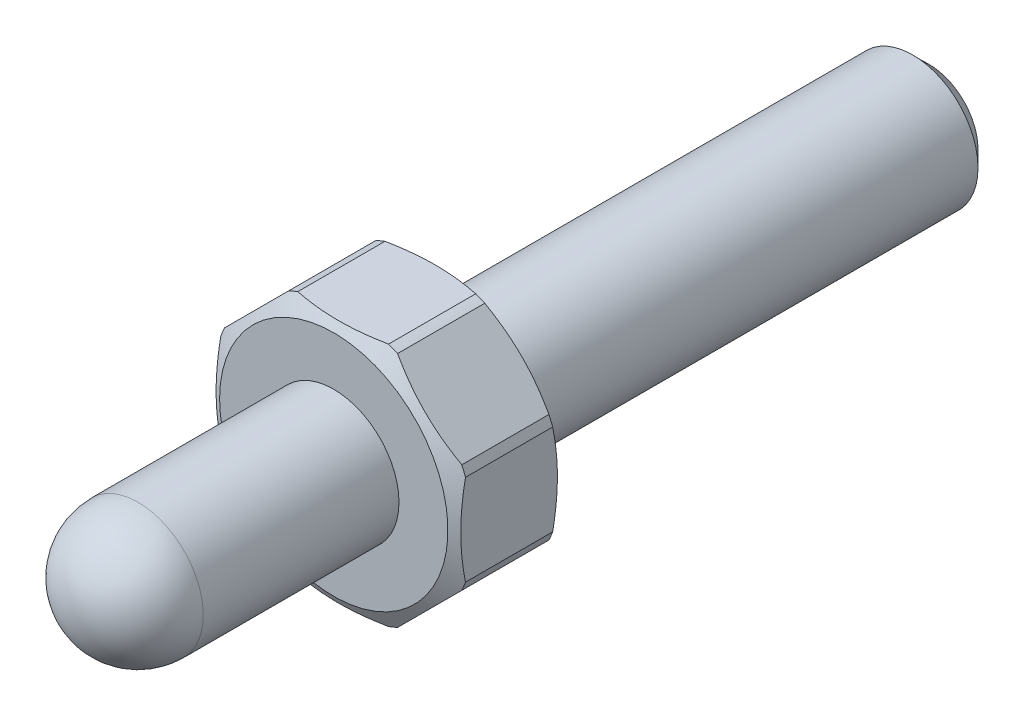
ISO-10303-21;
HEADER;
FILE_DESCRIPTION(('STEP AP214'),'2;1');
FILE_NAME('part.step','',(''),(''),'','','');
FILE_SCHEMA(('AUTOMOTIVE_DESIGN { 1 0 10303 214 1 1 1 1 }'));
ENDSEC;
DATA;
#1=APPLICATION_CONTEXT('core data for automotive mechanical design processes');
#2=APPLICATION_PROTOCOL_DEFINITION('international standard','automotive_design',2000,#1);
#3=PRODUCT_CONTEXT('',#1,'mechanical');
#4=PRODUCT('Part','Part','',(#3));
#5=PRODUCT_RELATED_PRODUCT_CATEGORY('part','',(#4));
#6=PRODUCT_DEFINITION_FORMATION('','',#4);
#7=PRODUCT_DEFINITION_CONTEXT('part definition',#1,'design');
#8=PRODUCT_DEFINITION('design','',#6,#7);
#9=PRODUCT_DEFINITION_SHAPE('','',#8);
#10=(LENGTH_UNIT() NAMED_UNIT(*) SI_UNIT(.MILLI.,.METRE.));
#11=(NAMED_UNIT(*) PLANE_ANGLE_UNIT() SI_UNIT($,.RADIAN.));
#12=(NAMED_UNIT(*) SI_UNIT($,.STERADIAN.) SOLID_ANGLE_UNIT());
#13=UNCERTAINTY_MEASURE_WITH_UNIT(LENGTH_MEASURE(1.E-05),#10,'distance_accuracy_value','');
#14=(GEOMETRIC_REPRESENTATION_CONTEXT(3) GLOBAL_UNCERTAINTY_ASSIGNED_CONTEXT((#13)) GLOBAL_UNIT_ASSIGNED_CONTEXT((#10,
#11,#12)) REPRESENTATION_CONTEXT('',''));
#15=CARTESIAN_POINT('',(0.,0.,0.));
#16=DIRECTION('',(0.,0.,1.));
#17=DIRECTION('',(1.,0.,0.));
#18=AXIS2_PLACEMENT_3D('',#15,#16,#17);
#19=CARTESIAN_POINT('',(-15.,6.21320343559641,73.));
#20=DIRECTION('',(-0.707106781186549,0.707106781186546,0.));
#21=DIRECTION('',(-0.707106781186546,-0.707106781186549,0.));
#22=AXIS2_PLACEMENT_3D('',#19,#20,#21);
#23=PLANE('',#22);
#24=CARTESIAN_POINT('',(-14.5438056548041,6.66939778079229,61.1547573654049));
#25=CARTESIAN_POINT('',(-14.2902564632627,6.92294697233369,61.082690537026));
#26=CARTESIAN_POINT('',(-14.0358395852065,7.1773638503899,61.0165370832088));
#27=CARTESIAN_POINT('',(-13.5254442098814,7.68775922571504,60.8970750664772));
#28=CARTESIAN_POINT('',(-13.269465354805,7.94373808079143,60.84376956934));
#29=CARTESIAN_POINT('',(-12.7561254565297,8.45707797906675,60.7510361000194));
#30=CARTESIAN_POINT('',(-12.4987638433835,8.71443959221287,60.7116143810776));
#31=CARTESIAN_POINT('',(-11.9831424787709,9.2300609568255,60.6475016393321));
#32=CARTESIAN_POINT('',(-11.7248828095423,9.48832062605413,60.6228093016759));
#33=CARTESIAN_POINT('',(-11.2119013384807,10.0013020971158,60.5889686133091));
#34=CARTESIAN_POINT('',(-10.9571874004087,10.2560160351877,60.5795831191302));
#35=CARTESIAN_POINT('',(-10.447691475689,10.7655119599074,60.5758244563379));
#36=CARTESIAN_POINT('',(-10.1929094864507,11.0202939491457,60.5814519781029));
#37=CARTESIAN_POINT('',(-9.6838808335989,11.5293226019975,60.6075861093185));
#38=CARTESIAN_POINT('',(-9.42963394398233,11.7835694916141,60.6280840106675));
#39=CARTESIAN_POINT('',(-8.92195224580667,12.2912511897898,60.6835005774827));
#40=CARTESIAN_POINT('',(-8.66851735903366,12.5446860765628,60.7184178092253));
#41=CARTESIAN_POINT('',(-8.26957513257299,12.9436283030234,60.7843093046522));
#42=CARTESIAN_POINT('',(-8.1236817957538,13.0895216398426,60.8107228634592));
#43=CARTESIAN_POINT('',(-7.83234301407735,13.3808604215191,60.8679445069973));
#44=CARTESIAN_POINT('',(-7.68689751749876,13.5263059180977,60.898752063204));
#45=CARTESIAN_POINT('',(-7.39580789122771,13.8173955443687,60.9647314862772));
#46=CARTESIAN_POINT('',(-7.25016600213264,13.9630374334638,60.9999230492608));
#47=CARTESIAN_POINT('',(-6.95939007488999,14.2538133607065,61.0743548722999));
#48=CARTESIAN_POINT('',(-6.81425607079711,14.3989473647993,61.113595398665));
#49=CARTESIAN_POINT('',(-6.66939778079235,14.5438056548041,61.1547573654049));
#50=B_SPLINE_CURVE_WITH_KNOTS('',3,(#24,#25,#26,#27,#28,#29,#30,#31,#32,#33,#34,#35,#36,#37,#38,
#39,#40,#41,#42,#43,#44,#45,#46,#47,#48,#49),.UNSPECIFIED.,.F.,.F.,(4,2,2,2,2,2,2,2,2,2,2,2,4),
(0.,1.09723602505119,2.19473361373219,3.29272488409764,4.39061812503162,5.47133470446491,
6.55210098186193,7.63223487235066,8.71226139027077,9.33624446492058,9.96015254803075,
10.586972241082,11.2138331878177),.UNSPECIFIED.);
#51=CARTESIAN_POINT('',(-14.5436056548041,6.66959778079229,61.1547005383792));
#52=VERTEX_POINT('',#51);
#53=CARTESIAN_POINT('',(-6.66959778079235,14.5436056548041,61.1547005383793));
#54=VERTEX_POINT('',#53);
#55=EDGE_CURVE('E210',#52,#54,#50,.T.);
#56=ORIENTED_EDGE('',*,*,#55,.F.);
#57=DIRECTION('',(0.,0.,-1.));
#58=VECTOR('',#57,1.);
#59=CARTESIAN_POINT('',(-14.5436056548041,6.66959778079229,28.0646408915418));
#60=LINE('',#59,#58);
#61=CARTESIAN_POINT('',(-14.5436056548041,6.66959778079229,71.8452994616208));
#62=VERTEX_POINT('',#61);
#63=EDGE_CURVE('E311',#62,#52,#60,.T.);
#64=ORIENTED_EDGE('',*,*,#63,.F.);
#65=CARTESIAN_POINT('',(-6.66939778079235,14.5438056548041,71.8452426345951));
#66=CARTESIAN_POINT('',(-6.92294697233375,14.2902564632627,71.917309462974));
#67=CARTESIAN_POINT('',(-7.17736385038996,14.0358395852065,71.9834629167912));
#68=CARTESIAN_POINT('',(-7.6877592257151,13.5254442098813,72.1029249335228));
#69=CARTESIAN_POINT('',(-7.94373808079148,13.269465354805,72.15623043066));
#70=CARTESIAN_POINT('',(-8.4570779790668,12.7561254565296,72.2489638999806));
#71=CARTESIAN_POINT('',(-8.71443959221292,12.4987638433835,72.2883856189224));
#72=CARTESIAN_POINT('',(-9.23006095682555,11.9831424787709,72.3524983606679));
#73=CARTESIAN_POINT('',(-9.48832062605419,11.7248828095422,72.3771906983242));
#74=CARTESIAN_POINT('',(-10.0013020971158,11.2119013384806,72.4110313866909));
#75=CARTESIAN_POINT('',(-10.2560160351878,10.9571874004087,72.4204168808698));
#76=CARTESIAN_POINT('',(-10.7655119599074,10.447691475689,72.4241755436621));
#77=CARTESIAN_POINT('',(-11.0202939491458,10.1929094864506,72.4185480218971));
#78=CARTESIAN_POINT('',(-11.5293226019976,9.68388083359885,72.3924138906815));
#79=CARTESIAN_POINT('',(-11.7835694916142,9.42963394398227,72.3719159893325));
#80=CARTESIAN_POINT('',(-12.2912511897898,8.92195224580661,72.3164994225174));
#81=CARTESIAN_POINT('',(-12.5446860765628,8.6685173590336,72.2815821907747));
#82=CARTESIAN_POINT('',(-12.9436283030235,8.26957513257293,72.2156906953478));
#83=CARTESIAN_POINT('',(-13.0895216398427,8.12368179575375,72.1892771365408));
#84=CARTESIAN_POINT('',(-13.3808604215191,7.83234301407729,72.1320554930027));
#85=CARTESIAN_POINT('',(-13.5263059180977,7.6868975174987,72.101247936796));
#86=CARTESIAN_POINT('',(-13.8173955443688,7.39580789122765,72.0352685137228));
#87=CARTESIAN_POINT('',(-13.9630374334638,7.25016600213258,72.0000769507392));
#88=CARTESIAN_POINT('',(-14.2538133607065,6.95939007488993,71.9256451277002));
#89=CARTESIAN_POINT('',(-14.3989473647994,6.81425607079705,71.886404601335));
#90=CARTESIAN_POINT('',(-14.5438056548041,6.66939778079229,71.8452426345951));
#91=B_SPLINE_CURVE_WITH_KNOTS('',3,(#65,#66,#67,#68,#69,#70,#71,#72,#73,#74,#75,#76,#77,#78,#79,
#80,#81,#82,#83,#84,#85,#86,#87,#88,#89,#90),.UNSPECIFIED.,.F.,.F.,(4,2,2,2,2,2,2,2,2,2,2,2,4),
(0.,1.0972360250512,2.1947336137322,3.29272488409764,4.39061812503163,5.47133470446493,
6.55210098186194,7.63223487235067,8.71226139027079,9.3362444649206,9.96015254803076,
10.586972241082,11.2138331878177),.UNSPECIFIED.);
#92=CARTESIAN_POINT('',(-6.66959778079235,14.5436056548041,71.8452994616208));
#93=VERTEX_POINT('',#92);
#94=EDGE_CURVE('E202',#93,#62,#91,.T.);
#95=ORIENTED_EDGE('',*,*,#94,.F.);
#96=DIRECTION('',(0.,0.,-1.));
#97=VECTOR('',#96,1.);
#98=CARTESIAN_POINT('',(-6.66959778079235,14.5436056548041,28.0646408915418));
#99=LINE('',#98,#97);
#100=EDGE_CURVE('E317',#54,#93,#99,.F.);
#101=ORIENTED_EDGE('',*,*,#100,.F.);
#102=EDGE_LOOP('',(#56,#64,#95,#101));
#103=FACE_BOUND('',#102,.T.);
#104=ADVANCED_FACE('F14',(#103),#23,.T.);
#105=CARTESIAN_POINT('',(-15.,6.21320343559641,73.));
#106=DIRECTION('',(1.,0.,0.));
#107=DIRECTION('',(0.,1.,0.));
#108=AXIS2_PLACEMENT_3D('',#105,#106,#107);
#109=PLANE('',#108);
#110=DIRECTION('',(0.,0.,-1.));
#111=VECTOR('',#110,1.);
#112=CARTESIAN_POINT('',(-15.,5.56776436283,28.0646408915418));
#113=LINE('',#112,#111);
#114=CARTESIAN_POINT('',(-15.,5.56776436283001,71.8452994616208));
#115=VERTEX_POINT('',#114);
#116=CARTESIAN_POINT('',(-15.,5.56776436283,61.1547005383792));
#117=VERTEX_POINT('',#116);
#118=EDGE_CURVE('E134',#115,#117,#113,.T.);
#119=ORIENTED_EDGE('',*,*,#118,.T.);
#120=CARTESIAN_POINT('',(-15.,-18.1688505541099,65.519879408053));
#121=CARTESIAN_POINT('',(-15.,-17.890435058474,65.3959253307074));
#122=CARTESIAN_POINT('',(-15.,-17.6115932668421,65.2729295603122));
#123=CARTESIAN_POINT('',(-15.,-17.052978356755,65.0290579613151));
#124=CARTESIAN_POINT('',(-15.,-16.7732052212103,64.9081821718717));
#125=CARTESIAN_POINT('',(-15.,-15.9322546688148,64.5489904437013));
#126=CARTESIAN_POINT('',(-15.,-15.3695766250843,64.3141684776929));
#127=CARTESIAN_POINT('',(-15.,-14.2362771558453,63.8545438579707));
#128=CARTESIAN_POINT('',(-15.,-13.6656284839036,63.6298081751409));
#129=CARTESIAN_POINT('',(-15.,-12.518977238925,63.1944805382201));
#130=CARTESIAN_POINT('',(-15.,-11.9429750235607,62.9838876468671));
#131=CARTESIAN_POINT('',(-15.,-10.7920650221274,62.5826310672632));
#132=CARTESIAN_POINT('',(-15.,-10.2172327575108,62.3917520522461));
#133=CARTESIAN_POINT('',(-15.,-9.06095624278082,62.0308560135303));
#134=CARTESIAN_POINT('',(-15.,-8.47951153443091,61.8608404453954));
#135=CARTESIAN_POINT('',(-15.,-7.31099132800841,61.5466329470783));
#136=CARTESIAN_POINT('',(-15.,-6.72393094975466,61.4023852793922));
#137=CARTESIAN_POINT('',(-15.,-5.54316218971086,61.1443838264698));
#138=CARTESIAN_POINT('',(-15.,-4.94945537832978,61.0306229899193));
#139=CARTESIAN_POINT('',(-15.,-4.00323017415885,60.8783636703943));
#140=CARTESIAN_POINT('',(-15.,-3.65256920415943,60.8282009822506));
#141=CARTESIAN_POINT('',(-15.,-2.94963060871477,60.7409761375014));
#142=CARTESIAN_POINT('',(-15.,-2.59735310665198,60.7039129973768));
#143=CARTESIAN_POINT('',(-15.,-1.89155266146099,60.6436103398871));
#144=CARTESIAN_POINT('',(-15.,-1.53802952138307,60.6203731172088));
#145=CARTESIAN_POINT('',(-15.,-0.830325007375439,60.5882172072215));
#146=CARTESIAN_POINT('',(-15.,-0.476143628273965,60.5792986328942));
#147=CARTESIAN_POINT('',(-15.,0.232896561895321,60.5759712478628));
#148=CARTESIAN_POINT('',(-15.,0.587755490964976,60.5815874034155));
#149=CARTESIAN_POINT('',(-15.,1.29694435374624,60.6072595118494));
#150=CARTESIAN_POINT('',(-15.,1.65127429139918,60.6273153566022));
#151=CARTESIAN_POINT('',(-15.,2.35874421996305,60.6814324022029));
#152=CARTESIAN_POINT('',(-15.,2.71188455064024,60.7154891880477));
#153=CARTESIAN_POINT('',(-15.,3.41664871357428,60.796928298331));
#154=CARTESIAN_POINT('',(-15.,3.76827239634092,60.8443119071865));
#155=CARTESIAN_POINT('',(-15.,4.49999927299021,60.9561772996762));
#156=CARTESIAN_POINT('',(-15.,4.87992998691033,61.0217849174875));
#157=CARTESIAN_POINT('',(-15.,5.63723949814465,61.166433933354));
#158=CARTESIAN_POINT('',(-15.,6.01461803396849,61.2454766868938));
#159=CARTESIAN_POINT('',(-15.,7.14290556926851,61.5007969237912));
#160=CARTESIAN_POINT('',(-15.,7.8897333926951,61.6952291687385));
#161=CARTESIAN_POINT('',(-15.,9.37514331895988,62.1229231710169));
#162=CARTESIAN_POINT('',(-15.,10.1136809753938,62.3563358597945));
#163=CARTESIAN_POINT('',(-15.,11.5805772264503,62.85261460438));
#164=CARTESIAN_POINT('',(-15.,12.3089373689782,63.1154761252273));
#165=CARTESIAN_POINT('',(-15.,13.7638862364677,63.6664257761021));
#166=CARTESIAN_POINT('',(-15.,14.4903925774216,63.9547296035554));
#167=CARTESIAN_POINT('',(-15.,15.9361344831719,64.5491037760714));
#168=CARTESIAN_POINT('',(-15.,16.6553694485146,64.8551755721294));
#169=CARTESIAN_POINT('',(-15.,17.7261189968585,65.3230884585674));
#170=CARTESIAN_POINT('',(-15.,18.0799274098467,65.4797183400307));
#171=CARTESIAN_POINT('',(-15.,18.7861966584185,65.79599439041));
#172=CARTESIAN_POINT('',(-15.,19.1386574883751,65.9556405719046));
#173=CARTESIAN_POINT('',(-15.,19.8422507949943,66.2775613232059));
#174=CARTESIAN_POINT('',(-15.,20.1933836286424,66.4398351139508));
#175=CARTESIAN_POINT('',(-15.,20.8945271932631,66.766773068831));
#176=CARTESIAN_POINT('',(-15.,21.2445379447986,66.9314371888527));
#177=CARTESIAN_POINT('',(-15.,21.594045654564,67.0971578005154));
#178=B_SPLINE_CURVE_WITH_KNOTS('',3,(#120,#121,#122,#123,#124,#125,#126,#127,#128,#129,#130,
#131,#132,#133,#134,#135,#136,#137,#138,#139,#140,#141,#142,#143,#144,#145,#146,#147,#148,#149,
#150,#151,#152,#153,#154,#155,#156,#157,#158,#159,#160,#161,#162,#163,#164,#165,#166,#167,#168,
#169,#170,#171,#172,#173,#174,#175,#176,#177),.UNSPECIFIED.,.F.,.F.,(4,2,2,2,2,2,2,2,2,2,2,2,2,
2,2,2,2,2,2,2,2,2,2,2,2,2,2,2,4),(0.,0.914282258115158,1.82858138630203,3.65760847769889,
5.49738144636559,7.33703237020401,9.15379835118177,10.9706910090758,12.7836047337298,
14.5960987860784,15.6585790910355,16.7209796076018,17.7835564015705,18.8461415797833,
19.910553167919,20.9749567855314,22.0390250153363,23.1031958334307,24.259582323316,
25.4160855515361,27.7297987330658,30.0526875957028,32.3752192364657,34.7197882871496,
37.0645490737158,38.2253229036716,39.3861015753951,40.5465421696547,41.7069613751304),.UNSPECIFIED.);
#179=CARTESIAN_POINT('',(-15.,-5.56776436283,61.1547005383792));
#180=VERTEX_POINT('',#179);
#181=EDGE_CURVE('E126',#117,#180,#178,.F.);
#182=ORIENTED_EDGE('',*,*,#181,.T.);
#183=DIRECTION('',(0.,0.,-1.));
#184=VECTOR('',#183,1.);
#185=CARTESIAN_POINT('',(-15.,-5.56776436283,28.0646408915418));
#186=LINE('',#185,#184);
#187=CARTESIAN_POINT('',(-15.,-5.56776436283,71.8452994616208));
#188=VERTEX_POINT('',#187);
#189=EDGE_CURVE('E36',#180,#188,#186,.F.);
#190=ORIENTED_EDGE('',*,*,#189,.T.);
#191=CARTESIAN_POINT('',(-15.,-18.1688505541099,67.480120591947));
#192=CARTESIAN_POINT('',(-15.,-17.890435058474,67.6040746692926));
#193=CARTESIAN_POINT('',(-15.,-17.6115932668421,67.7270704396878));
#194=CARTESIAN_POINT('',(-15.,-17.0529783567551,67.9709420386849));
#195=CARTESIAN_POINT('',(-15.,-16.7732052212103,68.0918178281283));
#196=CARTESIAN_POINT('',(-15.,-15.9322546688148,68.4510095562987));
#197=CARTESIAN_POINT('',(-15.,-15.3695766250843,68.6858315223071));
#198=CARTESIAN_POINT('',(-15.,-14.2362771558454,69.1454561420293));
#199=CARTESIAN_POINT('',(-15.,-13.6656284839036,69.3701918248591));
#200=CARTESIAN_POINT('',(-15.,-12.5189772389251,69.8055194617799));
#201=CARTESIAN_POINT('',(-15.,-11.9429750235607,70.0161123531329));
#202=CARTESIAN_POINT('',(-15.,-10.7920650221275,70.4173689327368));
#203=CARTESIAN_POINT('',(-15.,-10.2172327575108,70.6082479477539));
#204=CARTESIAN_POINT('',(-15.,-9.06095624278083,70.9691439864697));
#205=CARTESIAN_POINT('',(-15.,-8.47951153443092,71.1391595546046));
#206=CARTESIAN_POINT('',(-15.,-7.31099132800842,71.4533670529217));
#207=CARTESIAN_POINT('',(-15.,-6.72393094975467,71.5976147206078));
#208=CARTESIAN_POINT('',(-15.,-5.54316218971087,71.8556161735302));
#209=CARTESIAN_POINT('',(-15.,-4.94945537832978,71.9693770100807));
#210=CARTESIAN_POINT('',(-15.,-4.00323017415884,72.1216363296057));
#211=CARTESIAN_POINT('',(-15.,-3.65256920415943,72.1717990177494));
#212=CARTESIAN_POINT('',(-15.,-2.94963060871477,72.2590238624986));
#213=CARTESIAN_POINT('',(-15.,-2.59735310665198,72.2960870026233));
#214=CARTESIAN_POINT('',(-15.,-1.89155266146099,72.3563896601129));
#215=CARTESIAN_POINT('',(-15.,-1.53802952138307,72.3796268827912));
#216=CARTESIAN_POINT('',(-15.,-0.830325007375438,72.4117827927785));
#217=CARTESIAN_POINT('',(-15.,-0.476143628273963,72.4207013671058));
#218=CARTESIAN_POINT('',(-15.,0.232896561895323,72.4240287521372));
#219=CARTESIAN_POINT('',(-15.,0.587755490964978,72.4184125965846));
#220=CARTESIAN_POINT('',(-15.,1.29694435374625,72.3927404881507));
#221=CARTESIAN_POINT('',(-15.,1.65127429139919,72.3726846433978));
#222=CARTESIAN_POINT('',(-15.,2.35874421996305,72.3185675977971));
#223=CARTESIAN_POINT('',(-15.,2.71188455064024,72.2845108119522));
#224=CARTESIAN_POINT('',(-15.,3.41664871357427,72.203071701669));
#225=CARTESIAN_POINT('',(-15.,3.76827239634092,72.1556880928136));
#226=CARTESIAN_POINT('',(-15.,4.4999992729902,72.0438227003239));
#227=CARTESIAN_POINT('',(-15.,4.87992998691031,71.9782150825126));
#228=CARTESIAN_POINT('',(-15.,5.63723949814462,71.833566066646));
#229=CARTESIAN_POINT('',(-15.,6.01461803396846,71.7545233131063));
#230=CARTESIAN_POINT('',(-15.,7.14290556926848,71.4992030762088));
#231=CARTESIAN_POINT('',(-15.,7.88973339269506,71.3047708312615));
#232=CARTESIAN_POINT('',(-15.,9.37514331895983,70.8770768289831));
#233=CARTESIAN_POINT('',(-15.,10.1136809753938,70.6436641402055));
#234=CARTESIAN_POINT('',(-15.,11.5805772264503,70.14738539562));
#235=CARTESIAN_POINT('',(-15.,12.3089373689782,69.8845238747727));
#236=CARTESIAN_POINT('',(-15.,13.7638862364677,69.333574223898));
#237=CARTESIAN_POINT('',(-15.,14.4903925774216,69.0452703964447));
#238=CARTESIAN_POINT('',(-15.,15.9361344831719,68.4508962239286));
#239=CARTESIAN_POINT('',(-15.,16.6553694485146,68.1448244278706));
#240=CARTESIAN_POINT('',(-15.,17.7261189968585,67.6769115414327));
#241=CARTESIAN_POINT('',(-15.,18.0799274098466,67.5202816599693));
#242=CARTESIAN_POINT('',(-15.,18.7861966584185,67.20400560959));
#243=CARTESIAN_POINT('',(-15.,19.1386574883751,67.0443594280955));
#244=CARTESIAN_POINT('',(-15.,19.8422507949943,66.7224386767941));
#245=CARTESIAN_POINT('',(-15.,20.1933836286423,66.5601648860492));
#246=CARTESIAN_POINT('',(-15.,20.894527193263,66.233226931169));
#247=CARTESIAN_POINT('',(-15.,21.2445379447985,66.0685628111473));
#248=CARTESIAN_POINT('',(-15.,21.594045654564,65.9028421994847));
#249=B_SPLINE_CURVE_WITH_KNOTS('',3,(#191,#192,#193,#194,#195,#196,#197,#198,#199,#200,#201,
#202,#203,#204,#205,#206,#207,#208,#209,#210,#211,#212,#213,#214,#215,#216,#217,#218,#219,#220,
#221,#222,#223,#224,#225,#226,#227,#228,#229,#230,#231,#232,#233,#234,#235,#236,#237,#238,#239,
#240,#241,#242,#243,#244,#245,#246,#247,#248),.UNSPECIFIED.,.F.,.F.,(4,2,2,2,2,2,2,2,2,2,2,2,2,
2,2,2,2,2,2,2,2,2,2,2,2,2,2,2,4),(0.,0.914282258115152,1.82858138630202,3.65760847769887,
5.49738144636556,7.337032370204,9.15379835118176,10.9706910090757,12.7836047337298,
14.5960987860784,15.6585790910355,16.7209796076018,17.7835564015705,18.8461415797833,
19.910553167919,20.9749567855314,22.0390250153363,23.1031958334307,24.259582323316,
25.4160855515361,27.7297987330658,30.0526875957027,32.3752192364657,34.7197882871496,
37.0645490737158,38.2253229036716,39.3861015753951,40.5465421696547,41.7069613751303),.UNSPECIFIED.);
#250=EDGE_CURVE('E353',#188,#115,#249,.T.);
#251=ORIENTED_EDGE('',*,*,#250,.T.);
#252=EDGE_LOOP('',(#119,#182,#190,#251));
#253=FACE_BOUND('',#252,.T.);
#254=ADVANCED_FACE('F132',(#253),#109,.F.);
#255=CARTESIAN_POINT('',(-15.,-6.21320343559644,73.));
#256=DIRECTION('',(0.707106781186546,0.707106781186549,0.));
#257=DIRECTION('',(-0.707106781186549,0.707106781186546,0.));
#258=AXIS2_PLACEMENT_3D('',#255,#256,#257);
#259=PLANE('',#258);
#260=DIRECTION('',(0.,0.,-1.));
#261=VECTOR('',#260,1.);
#262=CARTESIAN_POINT('',(-14.5436056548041,-6.66959778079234,28.0646408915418));
#263=LINE('',#262,#261);
#264=CARTESIAN_POINT('',(-14.5436056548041,-6.66959778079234,71.8452994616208));
#265=VERTEX_POINT('',#264);
#266=CARTESIAN_POINT('',(-14.5436056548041,-6.66959778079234,61.1547005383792));
#267=VERTEX_POINT('',#266);
#268=EDGE_CURVE('E140',#265,#267,#263,.T.);
#269=ORIENTED_EDGE('',*,*,#268,.T.);
#270=CARTESIAN_POINT('',(-14.5438056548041,-6.66939778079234,61.1547573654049));
#271=CARTESIAN_POINT('',(-14.2902564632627,-6.92294697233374,61.082690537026));
#272=CARTESIAN_POINT('',(-14.0358395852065,-7.17736385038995,61.0165370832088));
#273=CARTESIAN_POINT('',(-13.5254442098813,-7.68775922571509,60.8970750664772));
#274=CARTESIAN_POINT('',(-13.269465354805,-7.94373808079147,60.84376956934));
#275=CARTESIAN_POINT('',(-12.7561254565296,-8.45707797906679,60.7510361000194));
#276=CARTESIAN_POINT('',(-12.4987638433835,-8.71443959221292,60.7116143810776));
#277=CARTESIAN_POINT('',(-11.9831424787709,-9.23006095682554,60.6475016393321));
#278=CARTESIAN_POINT('',(-11.7248828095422,-9.48832062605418,60.6228093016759));
#279=CARTESIAN_POINT('',(-11.2119013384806,-10.0013020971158,60.5889686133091));
#280=CARTESIAN_POINT('',(-10.9571874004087,-10.2560160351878,60.5795831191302));
#281=CARTESIAN_POINT('',(-10.447691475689,-10.7655119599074,60.5758244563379));
#282=CARTESIAN_POINT('',(-10.1929094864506,-11.0202939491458,60.5814519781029));
#283=CARTESIAN_POINT('',(-9.68388083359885,-11.5293226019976,60.6075861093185));
#284=CARTESIAN_POINT('',(-9.42963394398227,-11.7835694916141,60.6280840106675));
#285=CARTESIAN_POINT('',(-8.92195224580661,-12.2912511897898,60.6835005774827));
#286=CARTESIAN_POINT('',(-8.6685173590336,-12.5446860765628,60.7184178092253));
#287=CARTESIAN_POINT('',(-8.26957513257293,-12.9436283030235,60.7843093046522));
#288=CARTESIAN_POINT('',(-8.12368179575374,-13.0895216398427,60.8107228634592));
#289=CARTESIAN_POINT('',(-7.83234301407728,-13.3808604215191,60.8679445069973));
#290=CARTESIAN_POINT('',(-7.6868975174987,-13.5263059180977,60.898752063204));
#291=CARTESIAN_POINT('',(-7.39580789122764,-13.8173955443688,60.9647314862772));
#292=CARTESIAN_POINT('',(-7.25016600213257,-13.9630374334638,60.9999230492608));
#293=CARTESIAN_POINT('',(-6.95939007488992,-14.2538133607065,61.0743548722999));
#294=CARTESIAN_POINT('',(-6.81425607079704,-14.3989473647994,61.113595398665));
#295=CARTESIAN_POINT('',(-6.66939778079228,-14.5438056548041,61.1547573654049));
#296=B_SPLINE_CURVE_WITH_KNOTS('',3,(#270,#271,#272,#273,#274,#275,#276,#277,#278,#279,#280,
#281,#282,#283,#284,#285,#286,#287,#288,#289,#290,#291,#292,#293,#294,#295),.UNSPECIFIED.,.F.,
.F.,(4,2,2,2,2,2,2,2,2,2,2,2,4),(0.,1.0972360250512,2.19473361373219,3.29272488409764,
4.39061812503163,5.47133470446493,6.55210098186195,7.63223487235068,8.7122613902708,
9.33624446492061,9.96015254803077,10.586972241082,11.2138331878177),.UNSPECIFIED.);
#297=CARTESIAN_POINT('',(-6.66959778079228,-14.5436056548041,61.1547005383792));
#298=VERTEX_POINT('',#297);
#299=EDGE_CURVE('E29',#267,#298,#296,.T.);
#300=ORIENTED_EDGE('',*,*,#299,.T.);
#301=DIRECTION('',(0.,0.,-1.));
#302=VECTOR('',#301,1.);
#303=CARTESIAN_POINT('',(-6.66959778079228,-14.5436056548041,28.0646408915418));
#304=LINE('',#303,#302);
#305=CARTESIAN_POINT('',(-6.66959778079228,-14.5436056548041,71.8452994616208));
#306=VERTEX_POINT('',#305);
#307=EDGE_CURVE('E145',#298,#306,#304,.F.);
#308=ORIENTED_EDGE('',*,*,#307,.T.);
#309=CARTESIAN_POINT('',(-6.66939778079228,-14.5438056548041,71.8452426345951));
#310=CARTESIAN_POINT('',(-6.92294697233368,-14.2902564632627,71.917309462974));
#311=CARTESIAN_POINT('',(-7.1773638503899,-14.0358395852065,71.9834629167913));
#312=CARTESIAN_POINT('',(-7.68775922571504,-13.5254442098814,72.1029249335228));
#313=CARTESIAN_POINT('',(-7.94373808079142,-13.269465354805,72.15623043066));
#314=CARTESIAN_POINT('',(-8.45707797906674,-12.7561254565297,72.2489638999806));
#315=CARTESIAN_POINT('',(-8.71443959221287,-12.4987638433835,72.2883856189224));
#316=CARTESIAN_POINT('',(-9.23006095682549,-11.9831424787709,72.3524983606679));
#317=CARTESIAN_POINT('',(-9.48832062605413,-11.7248828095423,72.3771906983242));
#318=CARTESIAN_POINT('',(-10.0013020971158,-11.2119013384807,72.4110313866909));
#319=CARTESIAN_POINT('',(-10.2560160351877,-10.9571874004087,72.4204168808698));
#320=CARTESIAN_POINT('',(-10.7655119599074,-10.447691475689,72.4241755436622));
#321=CARTESIAN_POINT('',(-11.0202939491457,-10.1929094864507,72.4185480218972));
#322=CARTESIAN_POINT('',(-11.5293226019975,-9.6838808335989,72.3924138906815));
#323=CARTESIAN_POINT('',(-11.7835694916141,-9.42963394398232,72.3719159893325));
#324=CARTESIAN_POINT('',(-12.2912511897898,-8.92195224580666,72.3164994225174));
#325=CARTESIAN_POINT('',(-12.5446860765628,-8.66851735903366,72.2815821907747));
#326=CARTESIAN_POINT('',(-12.9436283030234,-8.26957513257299,72.2156906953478));
#327=CARTESIAN_POINT('',(-13.0895216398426,-8.1236817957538,72.1892771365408));
#328=CARTESIAN_POINT('',(-13.3808604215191,-7.83234301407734,72.1320554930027));
#329=CARTESIAN_POINT('',(-13.5263059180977,-7.68689751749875,72.101247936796));
#330=CARTESIAN_POINT('',(-13.8173955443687,-7.3958078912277,72.0352685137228));
#331=CARTESIAN_POINT('',(-13.9630374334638,-7.25016600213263,72.0000769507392));
#332=CARTESIAN_POINT('',(-14.2538133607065,-6.95939007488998,71.9256451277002));
#333=CARTESIAN_POINT('',(-14.3989473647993,-6.8142560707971,71.886404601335));
#334=CARTESIAN_POINT('',(-14.5438056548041,-6.66939778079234,71.8452426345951));
#335=B_SPLINE_CURVE_WITH_KNOTS('',3,(#309,#310,#311,#312,#313,#314,#315,#316,#317,#318,#319,
#320,#321,#322,#323,#324,#325,#326,#327,#328,#329,#330,#331,#332,#333,#334),.UNSPECIFIED.,.F.,
.F.,(4,2,2,2,2,2,2,2,2,2,2,2,4),(0.,1.0972360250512,2.1947336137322,3.29272488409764,
4.39061812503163,5.47133470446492,6.55210098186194,7.63223487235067,8.71226139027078,
9.3362444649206,9.96015254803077,10.586972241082,11.2138331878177),.UNSPECIFIED.);
#336=EDGE_CURVE('E344',#306,#265,#335,.T.);
#337=ORIENTED_EDGE('',*,*,#336,.T.);
#338=EDGE_LOOP('',(#269,#300,#308,#337));
#339=FACE_BOUND('',#338,.T.);
#340=ADVANCED_FACE('F190',(#339),#259,.F.);
#341=CARTESIAN_POINT('',(6.21320343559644,-15.,73.));
#342=DIRECTION('',(0.,-1.,0.));
#343=DIRECTION('',(0.,0.,-1.));
#344=AXIS2_PLACEMENT_3D('',#341,#342,#343);
#345=PLANE('',#344);
#346=CARTESIAN_POINT('',(-18.1688505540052,-15.,65.5198794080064));
#347=CARTESIAN_POINT('',(-17.8904350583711,-15.,65.3959253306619));
#348=CARTESIAN_POINT('',(-17.6115932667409,-15.,65.2729295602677));
#349=CARTESIAN_POINT('',(-17.0529783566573,-15.,65.0290579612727));
#350=CARTESIAN_POINT('',(-16.7732052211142,-15.,64.9081821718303));
#351=CARTESIAN_POINT('',(-15.9322546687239,-15.,64.5489904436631));
#352=CARTESIAN_POINT('',(-15.3695766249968,-15.,64.3141684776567));
#353=CARTESIAN_POINT('',(-14.2362771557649,-15.,63.8545438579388));
#354=CARTESIAN_POINT('',(-13.6656284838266,-15.,63.629808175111));
#355=CARTESIAN_POINT('',(-12.5189772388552,-15.,63.1944805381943));
#356=CARTESIAN_POINT('',(-11.9429750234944,-15.,62.9838876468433));
#357=CARTESIAN_POINT('',(-10.7920650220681,-15.,62.5826310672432));
#358=CARTESIAN_POINT('',(-10.2172327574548,-15.,62.3917520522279));
#359=CARTESIAN_POINT('',(-9.06095624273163,-15.,62.0308560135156));
#360=CARTESIAN_POINT('',(-8.47951153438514,-15.,61.8608404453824));
#361=CARTESIAN_POINT('',(-7.31099132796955,-15.,61.5466329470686));
#362=CARTESIAN_POINT('',(-6.72393094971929,-15.,61.4023852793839));
#363=CARTESIAN_POINT('',(-5.54316218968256,-15.,61.1443838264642));
#364=CARTESIAN_POINT('',(-4.94945537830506,-15.,61.0306229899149));
#365=CARTESIAN_POINT('',(-4.00323017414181,-15.,60.8783636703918));
#366=CARTESIAN_POINT('',(-3.65256920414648,-15.,60.8282009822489));
#367=CARTESIAN_POINT('',(-2.94963060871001,-15.,60.7409761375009));
#368=CARTESIAN_POINT('',(-2.59735310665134,-15.,60.7039129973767));
#369=CARTESIAN_POINT('',(-1.89155266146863,-15.,60.6436103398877));
#370=CARTESIAN_POINT('',(-1.53802952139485,-15.,60.6203731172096));
#371=CARTESIAN_POINT('',(-0.830325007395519,-15.,60.5882172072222));
#372=CARTESIAN_POINT('',(-0.476143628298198,-15.,60.5792986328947));
#373=CARTESIAN_POINT('',(0.232896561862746,-15.,60.5759712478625));
#374=CARTESIAN_POINT('',(0.587755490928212,-15.,60.5815874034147));
#375=CARTESIAN_POINT('',(1.29694435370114,-15.,60.6072595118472));
#376=CARTESIAN_POINT('',(1.65127429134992,-15.,60.6273153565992));
#377=CARTESIAN_POINT('',(2.35874421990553,-15.,60.6814324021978));
#378=CARTESIAN_POINT('',(2.71188455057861,-15.,60.7154891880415));
#379=CARTESIAN_POINT('',(3.4166487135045,-15.,60.7969282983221));
#380=CARTESIAN_POINT('',(3.7682723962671,-15.,60.8443119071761));
#381=CARTESIAN_POINT('',(4.4999992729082,-15.,60.9561772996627));
#382=CARTESIAN_POINT('',(4.8799299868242,-15.,61.0217849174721));
#383=CARTESIAN_POINT('',(5.63723949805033,-15.,61.1664339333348));
#384=CARTESIAN_POINT('',(6.01461803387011,-15.,61.2454766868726));
#385=CARTESIAN_POINT('',(7.14290556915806,-15.,61.5007969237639));
#386=CARTESIAN_POINT('',(7.88973339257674,-15.,61.6952291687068));
#387=CARTESIAN_POINT('',(9.37514331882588,-15.,62.122923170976));
#388=CARTESIAN_POINT('',(10.1136809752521,-15.,62.3563358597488));
#389=CARTESIAN_POINT('',(11.5805772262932,-15.,62.8526146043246));
#390=CARTESIAN_POINT('',(12.3089373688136,-15.,63.115476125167));
#391=CARTESIAN_POINT('',(13.7638862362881,-15.,63.6664257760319));
#392=CARTESIAN_POINT('',(14.4903925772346,-15.,63.9547296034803));
#393=CARTESIAN_POINT('',(15.9361344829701,-15.,64.5491037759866));
#394=CARTESIAN_POINT('',(16.6553694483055,-15.,64.8551755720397));
#395=CARTESIAN_POINT('',(17.7261189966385,-15.,65.3230884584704));
#396=CARTESIAN_POINT('',(18.079927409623,-15.,65.4797183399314));
#397=CARTESIAN_POINT('',(18.7861966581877,-15.,65.7959943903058));
#398=CARTESIAN_POINT('',(19.1386574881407,-15.,65.955640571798));
#399=CARTESIAN_POINT('',(19.8422507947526,-15.,66.2775613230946));
#400=CARTESIAN_POINT('',(20.1933836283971,-15.,66.4398351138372));
#401=CARTESIAN_POINT('',(20.8945271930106,-15.,66.7667730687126));
#402=CARTESIAN_POINT('',(21.2445379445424,-15.,66.9314371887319));
#403=CARTESIAN_POINT('',(21.5940456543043,-15.,67.0971578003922));
#404=B_SPLINE_CURVE_WITH_KNOTS('',3,(#346,#347,#348,#349,#350,#351,#352,#353,#354,#355,#356,
#357,#358,#359,#360,#361,#362,#363,#364,#365,#366,#367,#368,#369,#370,#371,#372,#373,#374,#375,
#376,#377,#378,#379,#380,#381,#382,#383,#384,#385,#386,#387,#388,#389,#390,#391,#392,#393,#394,
#395,#396,#397,#398,#399,#400,#401,#402,#403),.UNSPECIFIED.,.F.,.F.,(4,2,2,2,2,2,2,2,2,2,2,2,2,
2,2,2,2,2,2,2,2,2,2,2,2,2,2,2,4),(0.,0.91428225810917,1.82858138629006,3.65760847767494,
5.4973814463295,7.3370323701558,9.15379835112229,10.970691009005,12.7836047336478,
14.5960987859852,15.6585790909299,16.7209796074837,17.78355640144,18.8461415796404,
19.9105531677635,20.9749567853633,22.0390250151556,23.1031958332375,24.2595823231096,
25.4160855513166,27.72979873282,30.0526875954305,32.375219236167,34.7197882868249,
37.064549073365,38.225322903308,39.3861015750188,40.5465421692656,41.7069613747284),.UNSPECIFIED.);
#405=CARTESIAN_POINT('',(5.56776436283,-15.,61.1547005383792));
#406=VERTEX_POINT('',#405);
#407=CARTESIAN_POINT('',(-5.56776436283,-15.,61.1547005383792));
#408=VERTEX_POINT('',#407);
#409=EDGE_CURVE('E219',#406,#408,#404,.F.);
#410=ORIENTED_EDGE('',*,*,#409,.F.);
#411=DIRECTION('',(0.,0.,-1.));
#412=VECTOR('',#411,1.);
#413=CARTESIAN_POINT('',(5.56776436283,-15.,28.0646408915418));
#414=LINE('',#413,#412);
#415=CARTESIAN_POINT('',(5.56776436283,-15.,71.8452994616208));
#416=VERTEX_POINT('',#415);
#417=EDGE_CURVE('E336',#416,#406,#414,.T.);
#418=ORIENTED_EDGE('',*,*,#417,.F.);
#419=CARTESIAN_POINT('',(-18.1688505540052,-15.,67.4801205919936));
#420=CARTESIAN_POINT('',(-17.890435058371,-15.,67.6040746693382));
#421=CARTESIAN_POINT('',(-17.6115932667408,-15.,67.7270704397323));
#422=CARTESIAN_POINT('',(-17.0529783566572,-15.,67.9709420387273));
#423=CARTESIAN_POINT('',(-16.7732052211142,-15.,68.0918178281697));
#424=CARTESIAN_POINT('',(-15.9322546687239,-15.,68.4510095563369));
#425=CARTESIAN_POINT('',(-15.3695766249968,-15.,68.6858315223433));
#426=CARTESIAN_POINT('',(-14.2362771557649,-15.,69.1454561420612));
#427=CARTESIAN_POINT('',(-13.6656284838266,-15.,69.370191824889));
#428=CARTESIAN_POINT('',(-12.5189772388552,-15.,69.8055194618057));
#429=CARTESIAN_POINT('',(-11.9429750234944,-15.,70.0161123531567));
#430=CARTESIAN_POINT('',(-10.7920650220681,-15.,70.4173689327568));
#431=CARTESIAN_POINT('',(-10.2172327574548,-15.,70.6082479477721));
#432=CARTESIAN_POINT('',(-9.06095624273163,-15.,70.9691439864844));
#433=CARTESIAN_POINT('',(-8.47951153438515,-15.,71.1391595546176));
#434=CARTESIAN_POINT('',(-7.31099132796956,-15.,71.4533670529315));
#435=CARTESIAN_POINT('',(-6.7239309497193,-15.,71.5976147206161));
#436=CARTESIAN_POINT('',(-5.54316218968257,-15.,71.8556161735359));
#437=CARTESIAN_POINT('',(-4.94945537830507,-15.,71.9693770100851));
#438=CARTESIAN_POINT('',(-4.00323017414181,-15.,72.1216363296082));
#439=CARTESIAN_POINT('',(-3.65256920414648,-15.,72.1717990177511));
#440=CARTESIAN_POINT('',(-2.94963060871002,-15.,72.2590238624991));
#441=CARTESIAN_POINT('',(-2.59735310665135,-15.,72.2960870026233));
#442=CARTESIAN_POINT('',(-1.89155266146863,-15.,72.3563896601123));
#443=CARTESIAN_POINT('',(-1.53802952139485,-15.,72.3796268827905));
#444=CARTESIAN_POINT('',(-0.830325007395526,-15.,72.4117827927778));
#445=CARTESIAN_POINT('',(-0.476143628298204,-15.,72.4207013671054));
#446=CARTESIAN_POINT('',(0.232896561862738,-15.,72.4240287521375));
#447=CARTESIAN_POINT('',(0.587755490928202,-15.,72.4184125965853));
#448=CARTESIAN_POINT('',(1.29694435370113,-15.,72.3927404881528));
#449=CARTESIAN_POINT('',(1.65127429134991,-15.,72.3726846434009));
#450=CARTESIAN_POINT('',(2.35874421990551,-15.,72.3185675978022));
#451=CARTESIAN_POINT('',(2.7118845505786,-15.,72.2845108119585));
#452=CARTESIAN_POINT('',(3.41664871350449,-15.,72.2030717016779));
#453=CARTESIAN_POINT('',(3.76827239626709,-15.,72.1556880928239));
#454=CARTESIAN_POINT('',(4.49999927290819,-15.,72.0438227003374));
#455=CARTESIAN_POINT('',(4.87992998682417,-15.,71.9782150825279));
#456=CARTESIAN_POINT('',(5.63723949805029,-15.,71.8335660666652));
#457=CARTESIAN_POINT('',(6.01461803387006,-15.,71.7545233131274));
#458=CARTESIAN_POINT('',(7.14290556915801,-15.,71.4992030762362));
#459=CARTESIAN_POINT('',(7.88973339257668,-15.,71.3047708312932));
#460=CARTESIAN_POINT('',(9.37514331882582,-15.,70.8770768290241));
#461=CARTESIAN_POINT('',(10.113680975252,-15.,70.6436641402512));
#462=CARTESIAN_POINT('',(11.5805772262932,-15.,70.1473853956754));
#463=CARTESIAN_POINT('',(12.3089373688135,-15.,69.884523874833));
#464=CARTESIAN_POINT('',(13.763886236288,-15.,69.3335742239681));
#465=CARTESIAN_POINT('',(14.4903925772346,-15.,69.0452703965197));
#466=CARTESIAN_POINT('',(15.9361344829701,-15.,68.4508962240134));
#467=CARTESIAN_POINT('',(16.6553694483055,-15.,68.1448244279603));
#468=CARTESIAN_POINT('',(17.7261189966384,-15.,67.6769115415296));
#469=CARTESIAN_POINT('',(18.079927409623,-15.,67.5202816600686));
#470=CARTESIAN_POINT('',(18.7861966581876,-15.,67.2040056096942));
#471=CARTESIAN_POINT('',(19.1386574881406,-15.,67.044359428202));
#472=CARTESIAN_POINT('',(19.8422507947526,-15.,66.7224386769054));
#473=CARTESIAN_POINT('',(20.193383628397,-15.,66.5601648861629));
#474=CARTESIAN_POINT('',(20.8945271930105,-15.,66.2332269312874));
#475=CARTESIAN_POINT('',(21.2445379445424,-15.,66.0685628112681));
#476=CARTESIAN_POINT('',(21.5940456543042,-15.,65.9028421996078));
#477=B_SPLINE_CURVE_WITH_KNOTS('',3,(#419,#420,#421,#422,#423,#424,#425,#426,#427,#428,#429,
#430,#431,#432,#433,#434,#435,#436,#437,#438,#439,#440,#441,#442,#443,#444,#445,#446,#447,#448,
#449,#450,#451,#452,#453,#454,#455,#456,#457,#458,#459,#460,#461,#462,#463,#464,#465,#466,#467,
#468,#469,#470,#471,#472,#473,#474,#475,#476),.UNSPECIFIED.,.F.,.F.,(4,2,2,2,2,2,2,2,2,2,2,2,2,
2,2,2,2,2,2,2,2,2,2,2,2,2,2,2,4),(0.,0.914282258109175,1.82858138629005,3.65760847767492,
5.49738144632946,7.33703237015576,9.15379835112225,10.970691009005,12.7836047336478,
14.5960987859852,15.6585790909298,16.7209796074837,17.78355640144,18.8461415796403,
19.9105531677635,20.9749567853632,22.0390250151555,23.1031958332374,24.2595823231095,
25.4160855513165,27.7297987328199,30.0526875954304,32.3752192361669,34.7197882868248,
37.064549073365,38.225322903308,39.3861015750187,40.5465421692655,41.7069613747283),.UNSPECIFIED.);
#478=CARTESIAN_POINT('',(-5.56776436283,-15.,71.8452994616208));
#479=VERTEX_POINT('',#478);
#480=EDGE_CURVE('E361',#479,#416,#477,.T.);
#481=ORIENTED_EDGE('',*,*,#480,.F.);
#482=DIRECTION('',(0.,0.,-1.));
#483=VECTOR('',#482,1.);
#484=CARTESIAN_POINT('',(-5.56776436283,-15.,28.0646408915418));
#485=LINE('',#484,#483);
#486=EDGE_CURVE('E339',#408,#479,#485,.F.);
#487=ORIENTED_EDGE('',*,*,#486,.F.);
#488=EDGE_LOOP('',(#410,#418,#481,#487));
#489=FACE_BOUND('',#488,.T.);
#490=ADVANCED_FACE('F372',(#489),#345,.T.);
#491=CARTESIAN_POINT('',(6.21320343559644,-15.,73.));
#492=DIRECTION('',(-0.707106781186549,0.707106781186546,0.));
#493=DIRECTION('',(-0.707106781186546,-0.707106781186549,0.));
#494=AXIS2_PLACEMENT_3D('',#491,#492,#493);
#495=PLANE('',#494);
#496=DIRECTION('',(0.,0.,-1.));
#497=VECTOR('',#496,1.);
#498=CARTESIAN_POINT('',(6.66959778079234,-14.5436056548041,28.0646408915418));
#499=LINE('',#498,#497);
#500=CARTESIAN_POINT('',(6.66959778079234,-14.5436056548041,71.8452994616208));
#501=VERTEX_POINT('',#500);
#502=CARTESIAN_POINT('',(6.66959778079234,-14.5436056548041,61.1547005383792));
#503=VERTEX_POINT('',#502);
#504=EDGE_CURVE('E333',#501,#503,#499,.T.);
#505=ORIENTED_EDGE('',*,*,#504,.T.);
#506=CARTESIAN_POINT('',(6.66939778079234,-14.5438056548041,61.1547573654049));
#507=CARTESIAN_POINT('',(6.92294697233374,-14.2902564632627,61.082690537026));
#508=CARTESIAN_POINT('',(7.17736385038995,-14.0358395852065,61.0165370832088));
#509=CARTESIAN_POINT('',(7.68775922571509,-13.5254442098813,60.8970750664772));
#510=CARTESIAN_POINT('',(7.94373808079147,-13.269465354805,60.84376956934));
#511=CARTESIAN_POINT('',(8.45707797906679,-12.7561254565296,60.7510361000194));
#512=CARTESIAN_POINT('',(8.71443959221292,-12.4987638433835,60.7116143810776));
#513=CARTESIAN_POINT('',(9.23006095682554,-11.9831424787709,60.6475016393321));
#514=CARTESIAN_POINT('',(9.48832062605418,-11.7248828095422,60.6228093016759));
#515=CARTESIAN_POINT('',(10.0013020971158,-11.2119013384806,60.5889686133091));
#516=CARTESIAN_POINT('',(10.2560160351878,-10.9571874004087,60.5795831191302));
#517=CARTESIAN_POINT('',(10.7655119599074,-10.447691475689,60.5758244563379));
#518=CARTESIAN_POINT('',(11.0202939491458,-10.1929094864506,60.5814519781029));
#519=CARTESIAN_POINT('',(11.5293226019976,-9.68388083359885,60.6075861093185));
#520=CARTESIAN_POINT('',(11.7835694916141,-9.42963394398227,60.6280840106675));
#521=CARTESIAN_POINT('',(12.2912511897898,-8.92195224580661,60.6835005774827));
#522=CARTESIAN_POINT('',(12.5446860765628,-8.6685173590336,60.7184178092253));
#523=CARTESIAN_POINT('',(12.9436283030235,-8.26957513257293,60.7843093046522));
#524=CARTESIAN_POINT('',(13.0895216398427,-8.12368179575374,60.8107228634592));
#525=CARTESIAN_POINT('',(13.3808604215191,-7.83234301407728,60.8679445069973));
#526=CARTESIAN_POINT('',(13.5263059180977,-7.6868975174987,60.898752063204));
#527=CARTESIAN_POINT('',(13.8173955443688,-7.39580789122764,60.9647314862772));
#528=CARTESIAN_POINT('',(13.9630374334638,-7.25016600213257,60.9999230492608));
#529=CARTESIAN_POINT('',(14.2538133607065,-6.95939007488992,61.0743548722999));
#530=CARTESIAN_POINT('',(14.3989473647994,-6.81425607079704,61.113595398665));
#531=CARTESIAN_POINT('',(14.5438056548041,-6.66939778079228,61.1547573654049));
#532=B_SPLINE_CURVE_WITH_KNOTS('',3,(#506,#507,#508,#509,#510,#511,#512,#513,#514,#515,#516,
#517,#518,#519,#520,#521,#522,#523,#524,#525,#526,#527,#528,#529,#530,#531),.UNSPECIFIED.,.F.,
.F.,(4,2,2,2,2,2,2,2,2,2,2,2,4),(0.,1.0972360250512,2.19473361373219,3.29272488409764,
4.39061812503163,5.47133470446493,6.55210098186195,7.63223487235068,8.7122613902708,
9.33624446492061,9.96015254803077,10.586972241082,11.2138331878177),.UNSPECIFIED.);
#533=CARTESIAN_POINT('',(14.5436056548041,-6.66959778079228,61.1547005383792));
#534=VERTEX_POINT('',#533);
#535=EDGE_CURVE('E260',#503,#534,#532,.T.);
#536=ORIENTED_EDGE('',*,*,#535,.T.);
#537=DIRECTION('',(0.,0.,-1.));
#538=VECTOR('',#537,1.);
#539=CARTESIAN_POINT('',(14.5436056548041,-6.66959778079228,28.0646408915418));
#540=LINE('',#539,#538);
#541=CARTESIAN_POINT('',(14.5436056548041,-6.66959778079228,71.8452994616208));
#542=VERTEX_POINT('',#541);
#543=EDGE_CURVE('E331',#534,#542,#540,.F.);
#544=ORIENTED_EDGE('',*,*,#543,.T.);
#545=CARTESIAN_POINT('',(14.5438056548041,-6.66939778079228,71.8452426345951));
#546=CARTESIAN_POINT('',(14.2902564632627,-6.92294697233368,71.917309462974));
#547=CARTESIAN_POINT('',(14.0358395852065,-7.1773638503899,71.9834629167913));
#548=CARTESIAN_POINT('',(13.5254442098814,-7.68775922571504,72.1029249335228));
#549=CARTESIAN_POINT('',(13.269465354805,-7.94373808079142,72.15623043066));
#550=CARTESIAN_POINT('',(12.7561254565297,-8.45707797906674,72.2489638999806));
#551=CARTESIAN_POINT('',(12.4987638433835,-8.71443959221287,72.2883856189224));
#552=CARTESIAN_POINT('',(11.9831424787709,-9.23006095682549,72.3524983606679));
#553=CARTESIAN_POINT('',(11.7248828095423,-9.48832062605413,72.3771906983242));
#554=CARTESIAN_POINT('',(11.2119013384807,-10.0013020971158,72.4110313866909));
#555=CARTESIAN_POINT('',(10.9571874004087,-10.2560160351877,72.4204168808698));
#556=CARTESIAN_POINT('',(10.447691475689,-10.7655119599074,72.4241755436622));
#557=CARTESIAN_POINT('',(10.1929094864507,-11.0202939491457,72.4185480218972));
#558=CARTESIAN_POINT('',(9.6838808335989,-11.5293226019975,72.3924138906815));
#559=CARTESIAN_POINT('',(9.42963394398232,-11.7835694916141,72.3719159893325));
#560=CARTESIAN_POINT('',(8.92195224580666,-12.2912511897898,72.3164994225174));
#561=CARTESIAN_POINT('',(8.66851735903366,-12.5446860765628,72.2815821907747));
#562=CARTESIAN_POINT('',(8.26957513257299,-12.9436283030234,72.2156906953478));
#563=CARTESIAN_POINT('',(8.1236817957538,-13.0895216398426,72.1892771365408));
#564=CARTESIAN_POINT('',(7.83234301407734,-13.3808604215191,72.1320554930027));
#565=CARTESIAN_POINT('',(7.68689751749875,-13.5263059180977,72.101247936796));
#566=CARTESIAN_POINT('',(7.3958078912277,-13.8173955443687,72.0352685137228));
#567=CARTESIAN_POINT('',(7.25016600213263,-13.9630374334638,72.0000769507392));
#568=CARTESIAN_POINT('',(6.95939007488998,-14.2538133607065,71.9256451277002));
#569=CARTESIAN_POINT('',(6.8142560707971,-14.3989473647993,71.886404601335));
#570=CARTESIAN_POINT('',(6.66939778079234,-14.5438056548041,71.8452426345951));
#571=B_SPLINE_CURVE_WITH_KNOTS('',3,(#545,#546,#547,#548,#549,#550,#551,#552,#553,#554,#555,
#556,#557,#558,#559,#560,#561,#562,#563,#564,#565,#566,#567,#568,#569,#570),.UNSPECIFIED.,.F.,
.F.,(4,2,2,2,2,2,2,2,2,2,2,2,4),(0.,1.0972360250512,2.1947336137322,3.29272488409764,
4.39061812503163,5.47133470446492,6.55210098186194,7.63223487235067,8.71226139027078,
9.3362444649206,9.96015254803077,10.586972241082,11.2138331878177),.UNSPECIFIED.);
#572=EDGE_CURVE('E418',#542,#501,#571,.T.);
#573=ORIENTED_EDGE('',*,*,#572,.T.);
#574=EDGE_LOOP('',(#505,#536,#544,#573));
#575=FACE_BOUND('',#574,.T.);
#576=ADVANCED_FACE('F375',(#575),#495,.F.);
#577=CARTESIAN_POINT('',(15.,6.21320343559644,73.));
#578=DIRECTION('',(1.,0.,0.));
#579=DIRECTION('',(0.,1.,0.));
#580=AXIS2_PLACEMENT_3D('',#577,#578,#579);
#581=PLANE('',#580);
#582=CARTESIAN_POINT('',(15.,-18.1688505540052,65.5198794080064));
#583=CARTESIAN_POINT('',(15.,-17.8904350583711,65.3959253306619));
#584=CARTESIAN_POINT('',(15.,-17.6115932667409,65.2729295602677));
#585=CARTESIAN_POINT('',(15.,-17.0529783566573,65.0290579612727));
#586=CARTESIAN_POINT('',(15.,-16.7732052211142,64.9081821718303));
#587=CARTESIAN_POINT('',(15.,-15.9322546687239,64.5489904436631));
#588=CARTESIAN_POINT('',(15.,-15.3695766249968,64.3141684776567));
#589=CARTESIAN_POINT('',(15.,-14.2362771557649,63.8545438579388));
#590=CARTESIAN_POINT('',(15.,-13.6656284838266,63.629808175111));
#591=CARTESIAN_POINT('',(15.,-12.5189772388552,63.1944805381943));
#592=CARTESIAN_POINT('',(15.,-11.9429750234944,62.9838876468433));
#593=CARTESIAN_POINT('',(15.,-10.7920650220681,62.5826310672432));
#594=CARTESIAN_POINT('',(15.,-10.2172327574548,62.3917520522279));
#595=CARTESIAN_POINT('',(15.,-9.06095624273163,62.0308560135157));
#596=CARTESIAN_POINT('',(15.,-8.47951153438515,61.8608404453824));
#597=CARTESIAN_POINT('',(15.,-7.31099132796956,61.5466329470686));
#598=CARTESIAN_POINT('',(15.,-6.7239309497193,61.4023852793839));
#599=CARTESIAN_POINT('',(15.,-5.54316218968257,61.1443838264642));
#600=CARTESIAN_POINT('',(15.,-4.94945537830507,61.0306229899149));
#601=CARTESIAN_POINT('',(15.,-4.00323017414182,60.8783636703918));
#602=CARTESIAN_POINT('',(15.,-3.65256920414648,60.8282009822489));
#603=CARTESIAN_POINT('',(15.,-2.94963060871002,60.7409761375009));
#604=CARTESIAN_POINT('',(15.,-2.59735310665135,60.7039129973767));
#605=CARTESIAN_POINT('',(15.,-1.89155266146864,60.6436103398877));
#606=CARTESIAN_POINT('',(15.,-1.53802952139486,60.6203731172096));
#607=CARTESIAN_POINT('',(15.,-0.830325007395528,60.5882172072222));
#608=CARTESIAN_POINT('',(15.,-0.476143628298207,60.5792986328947));
#609=CARTESIAN_POINT('',(15.,0.232896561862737,60.5759712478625));
#610=CARTESIAN_POINT('',(15.,0.587755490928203,60.5815874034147));
#611=CARTESIAN_POINT('',(15.,1.29694435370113,60.6072595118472));
#612=CARTESIAN_POINT('',(15.,1.65127429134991,60.6273153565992));
#613=CARTESIAN_POINT('',(15.,2.35874421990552,60.6814324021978));
#614=CARTESIAN_POINT('',(15.,2.71188455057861,60.7154891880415));
#615=CARTESIAN_POINT('',(15.,3.41664871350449,60.7969282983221));
#616=CARTESIAN_POINT('',(15.,3.76827239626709,60.8443119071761));
#617=CARTESIAN_POINT('',(15.,4.4999992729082,60.9561772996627));
#618=CARTESIAN_POINT('',(15.,4.87992998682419,61.0217849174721));
#619=CARTESIAN_POINT('',(15.,5.63723949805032,61.1664339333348));
#620=CARTESIAN_POINT('',(15.,6.0146180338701,61.2454766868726));
#621=CARTESIAN_POINT('',(15.,7.14290556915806,61.5007969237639));
#622=CARTESIAN_POINT('',(15.,7.88973339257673,61.6952291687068));
#623=CARTESIAN_POINT('',(15.,9.37514331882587,62.122923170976));
#624=CARTESIAN_POINT('',(15.,10.1136809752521,62.3563358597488));
#625=CARTESIAN_POINT('',(15.,11.5805772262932,62.8526146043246));
#626=CARTESIAN_POINT('',(15.,12.3089373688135,63.115476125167));
#627=CARTESIAN_POINT('',(15.,13.763886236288,63.6664257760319));
#628=CARTESIAN_POINT('',(15.,14.4903925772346,63.9547296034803));
#629=CARTESIAN_POINT('',(15.,15.9361344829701,64.5491037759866));
#630=CARTESIAN_POINT('',(15.,16.6553694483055,64.8551755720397));
#631=CARTESIAN_POINT('',(15.,17.7261189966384,65.3230884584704));
#632=CARTESIAN_POINT('',(15.,18.079927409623,65.4797183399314));
#633=CARTESIAN_POINT('',(15.,18.7861966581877,65.7959943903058));
#634=CARTESIAN_POINT('',(15.,19.1386574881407,65.955640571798));
#635=CARTESIAN_POINT('',(15.,19.8422507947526,66.2775613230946));
#636=CARTESIAN_POINT('',(15.,20.1933836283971,66.4398351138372));
#637=CARTESIAN_POINT('',(15.,20.8945271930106,66.7667730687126));
#638=CARTESIAN_POINT('',(15.,21.2445379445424,66.9314371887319));
#639=CARTESIAN_POINT('',(15.,21.5940456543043,67.0971578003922));
#640=B_SPLINE_CURVE_WITH_KNOTS('',3,(#582,#583,#584,#585,#586,#587,#588,#589,#590,#591,#592,
#593,#594,#595,#596,#597,#598,#599,#600,#601,#602,#603,#604,#605,#606,#607,#608,#609,#610,#611,
#612,#613,#614,#615,#616,#617,#618,#619,#620,#621,#622,#623,#624,#625,#626,#627,#628,#629,#630,
#631,#632,#633,#634,#635,#636,#637,#638,#639),.UNSPECIFIED.,.F.,.F.,(4,2,2,2,2,2,2,2,2,2,2,2,2,
2,2,2,2,2,2,2,2,2,2,2,2,2,2,2,4),(0.,0.91428225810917,1.82858138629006,3.65760847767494,
5.4973814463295,7.3370323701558,9.15379835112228,10.970691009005,12.7836047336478,
14.5960987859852,15.6585790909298,16.7209796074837,17.78355640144,18.8461415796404,
19.9105531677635,20.9749567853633,22.0390250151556,23.1031958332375,24.2595823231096,
25.4160855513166,27.72979873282,30.0526875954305,32.375219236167,34.7197882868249,
37.064549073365,38.225322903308,39.3861015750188,40.5465421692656,41.7069613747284),.UNSPECIFIED.);
#641=CARTESIAN_POINT('',(15.,5.56776436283,61.1547005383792));
#642=VERTEX_POINT('',#641);
#643=CARTESIAN_POINT('',(15.,-5.56776436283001,61.1547005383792));
#644=VERTEX_POINT('',#643);
#645=EDGE_CURVE('E275',#642,#644,#640,.F.);
#646=ORIENTED_EDGE('',*,*,#645,.F.);
#647=DIRECTION('',(0.,0.,-1.));
#648=VECTOR('',#647,1.);
#649=CARTESIAN_POINT('',(15.,5.56776436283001,28.0646408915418));
#650=LINE('',#649,#648);
#651=CARTESIAN_POINT('',(15.,5.56776436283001,71.8452994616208));
#652=VERTEX_POINT('',#651);
#653=EDGE_CURVE('E326',#652,#642,#650,.T.);
#654=ORIENTED_EDGE('',*,*,#653,.F.);
#655=CARTESIAN_POINT('',(15.,-18.1688505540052,67.4801205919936));
#656=CARTESIAN_POINT('',(15.,-17.8904350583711,67.6040746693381));
#657=CARTESIAN_POINT('',(15.,-17.6115932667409,67.7270704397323));
#658=CARTESIAN_POINT('',(15.,-17.0529783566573,67.9709420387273));
#659=CARTESIAN_POINT('',(15.,-16.7732052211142,68.0918178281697));
#660=CARTESIAN_POINT('',(15.,-15.9322546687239,68.4510095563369));
#661=CARTESIAN_POINT('',(15.,-15.3695766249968,68.6858315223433));
#662=CARTESIAN_POINT('',(15.,-14.2362771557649,69.1454561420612));
#663=CARTESIAN_POINT('',(15.,-13.6656284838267,69.370191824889));
#664=CARTESIAN_POINT('',(15.,-12.5189772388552,69.8055194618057));
#665=CARTESIAN_POINT('',(15.,-11.9429750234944,70.0161123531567));
#666=CARTESIAN_POINT('',(15.,-10.7920650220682,70.4173689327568));
#667=CARTESIAN_POINT('',(15.,-10.2172327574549,70.6082479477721));
#668=CARTESIAN_POINT('',(15.,-9.06095624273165,70.9691439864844));
#669=CARTESIAN_POINT('',(15.,-8.47951153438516,71.1391595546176));
#670=CARTESIAN_POINT('',(15.,-7.31099132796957,71.4533670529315));
#671=CARTESIAN_POINT('',(15.,-6.72393094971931,71.5976147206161));
#672=CARTESIAN_POINT('',(15.,-5.54316218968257,71.8556161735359));
#673=CARTESIAN_POINT('',(15.,-4.94945537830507,71.9693770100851));
#674=CARTESIAN_POINT('',(15.,-4.00323017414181,72.1216363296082));
#675=CARTESIAN_POINT('',(15.,-3.65256920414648,72.1717990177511));
#676=CARTESIAN_POINT('',(15.,-2.94963060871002,72.2590238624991));
#677=CARTESIAN_POINT('',(15.,-2.59735310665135,72.2960870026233));
#678=CARTESIAN_POINT('',(15.,-1.89155266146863,72.3563896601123));
#679=CARTESIAN_POINT('',(15.,-1.53802952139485,72.3796268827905));
#680=CARTESIAN_POINT('',(15.,-0.830325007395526,72.4117827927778));
#681=CARTESIAN_POINT('',(15.,-0.476143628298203,72.4207013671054));
#682=CARTESIAN_POINT('',(15.,0.23289656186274,72.4240287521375));
#683=CARTESIAN_POINT('',(15.,0.587755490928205,72.4184125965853));
#684=CARTESIAN_POINT('',(15.,1.29694435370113,72.3927404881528));
#685=CARTESIAN_POINT('',(15.,1.65127429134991,72.3726846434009));
#686=CARTESIAN_POINT('',(15.,2.35874421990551,72.3185675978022));
#687=CARTESIAN_POINT('',(15.,2.7118845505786,72.2845108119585));
#688=CARTESIAN_POINT('',(15.,3.41664871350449,72.2030717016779));
#689=CARTESIAN_POINT('',(15.,3.76827239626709,72.1556880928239));
#690=CARTESIAN_POINT('',(15.,4.49999927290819,72.0438227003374));
#691=CARTESIAN_POINT('',(15.,4.87992998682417,71.9782150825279));
#692=CARTESIAN_POINT('',(15.,5.63723949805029,71.8335660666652));
#693=CARTESIAN_POINT('',(15.,6.01461803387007,71.7545233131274));
#694=CARTESIAN_POINT('',(15.,7.14290556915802,71.4992030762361));
#695=CARTESIAN_POINT('',(15.,7.88973339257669,71.3047708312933));
#696=CARTESIAN_POINT('',(15.,9.37514331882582,70.8770768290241));
#697=CARTESIAN_POINT('',(15.,10.113680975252,70.6436641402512));
#698=CARTESIAN_POINT('',(15.,11.5805772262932,70.1473853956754));
#699=CARTESIAN_POINT('',(15.,12.3089373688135,69.884523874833));
#700=CARTESIAN_POINT('',(15.,13.763886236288,69.3335742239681));
#701=CARTESIAN_POINT('',(15.,14.4903925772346,69.0452703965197));
#702=CARTESIAN_POINT('',(15.,15.9361344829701,68.4508962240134));
#703=CARTESIAN_POINT('',(15.,16.6553694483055,68.1448244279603));
#704=CARTESIAN_POINT('',(15.,17.7261189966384,67.6769115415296));
#705=CARTESIAN_POINT('',(15.,18.079927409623,67.5202816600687));
#706=CARTESIAN_POINT('',(15.,18.7861966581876,67.2040056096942));
#707=CARTESIAN_POINT('',(15.,19.1386574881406,67.044359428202));
#708=CARTESIAN_POINT('',(15.,19.8422507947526,66.7224386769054));
#709=CARTESIAN_POINT('',(15.,20.193383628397,66.5601648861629));
#710=CARTESIAN_POINT('',(15.,20.8945271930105,66.2332269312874));
#711=CARTESIAN_POINT('',(15.,21.2445379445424,66.0685628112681));
#712=CARTESIAN_POINT('',(15.,21.5940456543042,65.9028421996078));
#713=B_SPLINE_CURVE_WITH_KNOTS('',3,(#655,#656,#657,#658,#659,#660,#661,#662,#663,#664,#665,
#666,#667,#668,#669,#670,#671,#672,#673,#674,#675,#676,#677,#678,#679,#680,#681,#682,#683,#684,
#685,#686,#687,#688,#689,#690,#691,#692,#693,#694,#695,#696,#697,#698,#699,#700,#701,#702,#703,
#704,#705,#706,#707,#708,#709,#710,#711,#712),.UNSPECIFIED.,.F.,.F.,(4,2,2,2,2,2,2,2,2,2,2,2,2,
2,2,2,2,2,2,2,2,2,2,2,2,2,2,2,4),(0.,0.914282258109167,1.82858138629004,3.65760847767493,
5.49738144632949,7.33703237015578,9.15379835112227,10.970691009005,12.7836047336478,
14.5960987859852,15.6585790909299,16.7209796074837,17.78355640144,18.8461415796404,
19.9105531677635,20.9749567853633,22.0390250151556,23.1031958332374,24.2595823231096,
25.4160855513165,27.72979873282,30.0526875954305,32.375219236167,34.7197882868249,
37.064549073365,38.225322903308,39.3861015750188,40.5465421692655,41.7069613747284),.UNSPECIFIED.);
#714=CARTESIAN_POINT('',(15.,-5.56776436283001,71.8452994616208));
#715=VERTEX_POINT('',#714);
#716=EDGE_CURVE('E299',#715,#652,#713,.T.);
#717=ORIENTED_EDGE('',*,*,#716,.F.);
#718=DIRECTION('',(0.,0.,-1.));
#719=VECTOR('',#718,1.);
#720=CARTESIAN_POINT('',(15.,-5.56776436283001,28.0646408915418));
#721=LINE('',#720,#719);
#722=EDGE_CURVE('E329',#644,#715,#721,.F.);
#723=ORIENTED_EDGE('',*,*,#722,.F.);
#724=EDGE_LOOP('',(#646,#654,#717,#723));
#725=FACE_BOUND('',#724,.T.);
#726=ADVANCED_FACE('F286',(#725),#581,.T.);
#727=CARTESIAN_POINT('',(15.,6.21320343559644,73.));
#728=DIRECTION('',(-0.707106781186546,-0.707106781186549,0.));
#729=DIRECTION('',(0.707106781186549,-0.707106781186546,0.));
#730=AXIS2_PLACEMENT_3D('',#727,#728,#729);
#731=PLANE('',#730);
#732=DIRECTION('',(0.,0.,-1.));
#733=VECTOR('',#732,1.);
#734=CARTESIAN_POINT('',(14.5436056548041,6.66959778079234,28.0646408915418));
#735=LINE('',#734,#733);
#736=CARTESIAN_POINT('',(14.5436056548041,6.66959778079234,71.8452994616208));
#737=VERTEX_POINT('',#736);
#738=CARTESIAN_POINT('',(14.5436056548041,6.66959778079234,61.1547005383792));
#739=VERTEX_POINT('',#738);
#740=EDGE_CURVE('E323',#737,#739,#735,.T.);
#741=ORIENTED_EDGE('',*,*,#740,.T.);
#742=CARTESIAN_POINT('',(14.5438056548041,6.66939778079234,61.1547573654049));
#743=CARTESIAN_POINT('',(14.2902564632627,6.92294697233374,61.082690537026));
#744=CARTESIAN_POINT('',(14.0358395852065,7.17736385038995,61.0165370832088));
#745=CARTESIAN_POINT('',(13.5254442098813,7.68775922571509,60.8970750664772));
#746=CARTESIAN_POINT('',(13.269465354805,7.94373808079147,60.84376956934));
#747=CARTESIAN_POINT('',(12.7561254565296,8.45707797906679,60.7510361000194));
#748=CARTESIAN_POINT('',(12.4987638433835,8.71443959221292,60.7116143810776));
#749=CARTESIAN_POINT('',(11.9831424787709,9.23006095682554,60.6475016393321));
#750=CARTESIAN_POINT('',(11.7248828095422,9.48832062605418,60.6228093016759));
#751=CARTESIAN_POINT('',(11.2119013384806,10.0013020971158,60.5889686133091));
#752=CARTESIAN_POINT('',(10.9571874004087,10.2560160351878,60.5795831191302));
#753=CARTESIAN_POINT('',(10.447691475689,10.7655119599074,60.5758244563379));
#754=CARTESIAN_POINT('',(10.1929094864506,11.0202939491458,60.5814519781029));
#755=CARTESIAN_POINT('',(9.68388083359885,11.5293226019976,60.6075861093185));
#756=CARTESIAN_POINT('',(9.42963394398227,11.7835694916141,60.6280840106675));
#757=CARTESIAN_POINT('',(8.92195224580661,12.2912511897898,60.6835005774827));
#758=CARTESIAN_POINT('',(8.6685173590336,12.5446860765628,60.7184178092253));
#759=CARTESIAN_POINT('',(8.26957513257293,12.9436283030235,60.7843093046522));
#760=CARTESIAN_POINT('',(8.12368179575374,13.0895216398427,60.8107228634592));
#761=CARTESIAN_POINT('',(7.83234301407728,13.3808604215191,60.8679445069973));
#762=CARTESIAN_POINT('',(7.6868975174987,13.5263059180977,60.898752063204));
#763=CARTESIAN_POINT('',(7.39580789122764,13.8173955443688,60.9647314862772));
#764=CARTESIAN_POINT('',(7.25016600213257,13.9630374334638,60.9999230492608));
#765=CARTESIAN_POINT('',(6.95939007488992,14.2538133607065,61.0743548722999));
#766=CARTESIAN_POINT('',(6.81425607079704,14.3989473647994,61.113595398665));
#767=CARTESIAN_POINT('',(6.66939778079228,14.5438056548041,61.1547573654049));
#768=B_SPLINE_CURVE_WITH_KNOTS('',3,(#742,#743,#744,#745,#746,#747,#748,#749,#750,#751,#752,
#753,#754,#755,#756,#757,#758,#759,#760,#761,#762,#763,#764,#765,#766,#767),.UNSPECIFIED.,.F.,
.F.,(4,2,2,2,2,2,2,2,2,2,2,2,4),(0.,1.0972360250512,2.19473361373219,3.29272488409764,
4.39061812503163,5.47133470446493,6.55210098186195,7.63223487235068,8.7122613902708,
9.33624446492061,9.96015254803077,10.586972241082,11.2138331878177),.UNSPECIFIED.);
#769=CARTESIAN_POINT('',(6.66959778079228,14.5436056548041,61.1547005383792));
#770=VERTEX_POINT('',#769);
#771=EDGE_CURVE('E268',#739,#770,#768,.T.);
#772=ORIENTED_EDGE('',*,*,#771,.T.);
#773=DIRECTION('',(0.,0.,-1.));
#774=VECTOR('',#773,1.);
#775=CARTESIAN_POINT('',(6.66959778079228,14.5436056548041,28.0646408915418));
#776=LINE('',#775,#774);
#777=CARTESIAN_POINT('',(6.66959778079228,14.5436056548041,71.8452994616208));
#778=VERTEX_POINT('',#777);
#779=EDGE_CURVE('E321',#770,#778,#776,.F.);
#780=ORIENTED_EDGE('',*,*,#779,.T.);
#781=CARTESIAN_POINT('',(6.66939778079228,14.5438056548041,71.8452426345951));
#782=CARTESIAN_POINT('',(6.92294697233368,14.2902564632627,71.917309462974));
#783=CARTESIAN_POINT('',(7.1773638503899,14.0358395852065,71.9834629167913));
#784=CARTESIAN_POINT('',(7.68775922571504,13.5254442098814,72.1029249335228));
#785=CARTESIAN_POINT('',(7.94373808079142,13.269465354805,72.15623043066));
#786=CARTESIAN_POINT('',(8.45707797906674,12.7561254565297,72.2489638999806));
#787=CARTESIAN_POINT('',(8.71443959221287,12.4987638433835,72.2883856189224));
#788=CARTESIAN_POINT('',(9.23006095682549,11.9831424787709,72.3524983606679));
#789=CARTESIAN_POINT('',(9.48832062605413,11.7248828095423,72.3771906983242));
#790=CARTESIAN_POINT('',(10.0013020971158,11.2119013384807,72.4110313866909));
#791=CARTESIAN_POINT('',(10.2560160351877,10.9571874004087,72.4204168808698));
#792=CARTESIAN_POINT('',(10.7655119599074,10.447691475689,72.4241755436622));
#793=CARTESIAN_POINT('',(11.0202939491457,10.1929094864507,72.4185480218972));
#794=CARTESIAN_POINT('',(11.5293226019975,9.6838808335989,72.3924138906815));
#795=CARTESIAN_POINT('',(11.7835694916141,9.42963394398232,72.3719159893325));
#796=CARTESIAN_POINT('',(12.2912511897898,8.92195224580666,72.3164994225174));
#797=CARTESIAN_POINT('',(12.5446860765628,8.66851735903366,72.2815821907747));
#798=CARTESIAN_POINT('',(12.9436283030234,8.26957513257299,72.2156906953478));
#799=CARTESIAN_POINT('',(13.0895216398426,8.1236817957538,72.1892771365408));
#800=CARTESIAN_POINT('',(13.3808604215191,7.83234301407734,72.1320554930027));
#801=CARTESIAN_POINT('',(13.5263059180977,7.68689751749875,72.101247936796));
#802=CARTESIAN_POINT('',(13.8173955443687,7.3958078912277,72.0352685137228));
#803=CARTESIAN_POINT('',(13.9630374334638,7.25016600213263,72.0000769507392));
#804=CARTESIAN_POINT('',(14.2538133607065,6.95939007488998,71.9256451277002));
#805=CARTESIAN_POINT('',(14.3989473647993,6.8142560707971,71.886404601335));
#806=CARTESIAN_POINT('',(14.5438056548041,6.66939778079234,71.8452426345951));
#807=B_SPLINE_CURVE_WITH_KNOTS('',3,(#781,#782,#783,#784,#785,#786,#787,#788,#789,#790,#791,
#792,#793,#794,#795,#796,#797,#798,#799,#800,#801,#802,#803,#804,#805,#806),.UNSPECIFIED.,.F.,
.F.,(4,2,2,2,2,2,2,2,2,2,2,2,4),(0.,1.0972360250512,2.1947336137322,3.29272488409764,
4.39061812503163,5.47133470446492,6.55210098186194,7.63223487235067,8.71226139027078,
9.3362444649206,9.96015254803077,10.586972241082,11.2138331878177),.UNSPECIFIED.);
#808=EDGE_CURVE('E291',#778,#737,#807,.T.);
#809=ORIENTED_EDGE('',*,*,#808,.T.);
#810=EDGE_LOOP('',(#741,#772,#780,#809));
#811=FACE_BOUND('',#810,.T.);
#812=ADVANCED_FACE('F283',(#811),#731,.F.);
#813=CARTESIAN_POINT('',(-6.21320343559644,15.,73.));
#814=DIRECTION('',(0.,1.,0.));
#815=DIRECTION('',(0.,0.,1.));
#816=AXIS2_PLACEMENT_3D('',#813,#814,#815);
#817=PLANE('',#816);
#818=CARTESIAN_POINT('',(-18.1688505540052,15.,65.5198794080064));
#819=CARTESIAN_POINT('',(-17.8904350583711,15.,65.3959253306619));
#820=CARTESIAN_POINT('',(-17.6115932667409,15.,65.2729295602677));
#821=CARTESIAN_POINT('',(-17.0529783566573,15.,65.0290579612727));
#822=CARTESIAN_POINT('',(-16.7732052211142,15.,64.9081821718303));
#823=CARTESIAN_POINT('',(-15.9322546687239,15.,64.5489904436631));
#824=CARTESIAN_POINT('',(-15.3695766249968,15.,64.3141684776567));
#825=CARTESIAN_POINT('',(-14.2362771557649,15.,63.8545438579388));
#826=CARTESIAN_POINT('',(-13.6656284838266,15.,63.629808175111));
#827=CARTESIAN_POINT('',(-12.5189772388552,15.,63.1944805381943));
#828=CARTESIAN_POINT('',(-11.9429750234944,15.,62.9838876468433));
#829=CARTESIAN_POINT('',(-10.7920650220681,15.,62.5826310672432));
#830=CARTESIAN_POINT('',(-10.2172327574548,15.,62.3917520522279));
#831=CARTESIAN_POINT('',(-9.06095624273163,15.,62.0308560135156));
#832=CARTESIAN_POINT('',(-8.47951153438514,15.,61.8608404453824));
#833=CARTESIAN_POINT('',(-7.31099132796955,15.,61.5466329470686));
#834=CARTESIAN_POINT('',(-6.72393094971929,15.,61.4023852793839));
#835=CARTESIAN_POINT('',(-5.54316218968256,15.,61.1443838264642));
#836=CARTESIAN_POINT('',(-4.94945537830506,15.,61.0306229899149));
#837=CARTESIAN_POINT('',(-4.00323017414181,15.,60.8783636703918));
#838=CARTESIAN_POINT('',(-3.65256920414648,15.,60.8282009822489));
#839=CARTESIAN_POINT('',(-2.94963060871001,15.,60.7409761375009));
#840=CARTESIAN_POINT('',(-2.59735310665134,15.,60.7039129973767));
#841=CARTESIAN_POINT('',(-1.89155266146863,15.,60.6436103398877));
#842=CARTESIAN_POINT('',(-1.53802952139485,15.,60.6203731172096));
#843=CARTESIAN_POINT('',(-0.830325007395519,15.,60.5882172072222));
#844=CARTESIAN_POINT('',(-0.476143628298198,15.,60.5792986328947));
#845=CARTESIAN_POINT('',(0.232896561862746,15.,60.5759712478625));
#846=CARTESIAN_POINT('',(0.587755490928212,15.,60.5815874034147));
#847=CARTESIAN_POINT('',(1.29694435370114,15.,60.6072595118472));
#848=CARTESIAN_POINT('',(1.65127429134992,15.,60.6273153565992));
#849=CARTESIAN_POINT('',(2.35874421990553,15.,60.6814324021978));
#850=CARTESIAN_POINT('',(2.71188455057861,15.,60.7154891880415));
#851=CARTESIAN_POINT('',(3.4166487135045,15.,60.7969282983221));
#852=CARTESIAN_POINT('',(3.7682723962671,15.,60.8443119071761));
#853=CARTESIAN_POINT('',(4.4999992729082,15.,60.9561772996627));
#854=CARTESIAN_POINT('',(4.8799299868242,15.,61.0217849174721));
#855=CARTESIAN_POINT('',(5.63723949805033,15.,61.1664339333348));
#856=CARTESIAN_POINT('',(6.01461803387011,15.,61.2454766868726));
#857=CARTESIAN_POINT('',(7.14290556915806,15.,61.5007969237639));
#858=CARTESIAN_POINT('',(7.88973339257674,15.,61.6952291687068));
#859=CARTESIAN_POINT('',(9.37514331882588,15.,62.122923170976));
#860=CARTESIAN_POINT('',(10.1136809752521,15.,62.3563358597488));
#861=CARTESIAN_POINT('',(11.5805772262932,15.,62.8526146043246));
#862=CARTESIAN_POINT('',(12.3089373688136,15.,63.115476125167));
#863=CARTESIAN_POINT('',(13.7638862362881,15.,63.6664257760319));
#864=CARTESIAN_POINT('',(14.4903925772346,15.,63.9547296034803));
#865=CARTESIAN_POINT('',(15.9361344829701,15.,64.5491037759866));
#866=CARTESIAN_POINT('',(16.6553694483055,15.,64.8551755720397));
#867=CARTESIAN_POINT('',(17.7261189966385,15.,65.3230884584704));
#868=CARTESIAN_POINT('',(18.079927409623,15.,65.4797183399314));
#869=CARTESIAN_POINT('',(18.7861966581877,15.,65.7959943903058));
#870=CARTESIAN_POINT('',(19.1386574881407,15.,65.955640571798));
#871=CARTESIAN_POINT('',(19.8422507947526,15.,66.2775613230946));
#872=CARTESIAN_POINT('',(20.1933836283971,15.,66.4398351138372));
#873=CARTESIAN_POINT('',(20.8945271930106,15.,66.7667730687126));
#874=CARTESIAN_POINT('',(21.2445379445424,15.,66.9314371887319));
#875=CARTESIAN_POINT('',(21.5940456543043,15.,67.0971578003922));
#876=B_SPLINE_CURVE_WITH_KNOTS('',3,(#818,#819,#820,#821,#822,#823,#824,#825,#826,#827,#828,
#829,#830,#831,#832,#833,#834,#835,#836,#837,#838,#839,#840,#841,#842,#843,#844,#845,#846,#847,
#848,#849,#850,#851,#852,#853,#854,#855,#856,#857,#858,#859,#860,#861,#862,#863,#864,#865,#866,
#867,#868,#869,#870,#871,#872,#873,#874,#875),.UNSPECIFIED.,.F.,.F.,(4,2,2,2,2,2,2,2,2,2,2,2,2,
2,2,2,2,2,2,2,2,2,2,2,2,2,2,2,4),(0.,0.91428225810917,1.82858138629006,3.65760847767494,
5.4973814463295,7.3370323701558,9.15379835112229,10.970691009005,12.7836047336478,
14.5960987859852,15.6585790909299,16.7209796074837,17.78355640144,18.8461415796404,
19.9105531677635,20.9749567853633,22.0390250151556,23.1031958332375,24.2595823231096,
25.4160855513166,27.72979873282,30.0526875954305,32.375219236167,34.7197882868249,
37.064549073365,38.225322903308,39.3861015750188,40.5465421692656,41.7069613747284),.UNSPECIFIED.);
#877=CARTESIAN_POINT('',(-5.56776436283,15.,61.1547005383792));
#878=VERTEX_POINT('',#877);
#879=CARTESIAN_POINT('',(5.56776436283,15.,61.1547005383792));
#880=VERTEX_POINT('',#879);
#881=EDGE_CURVE('E254',#878,#880,#876,.T.);
#882=ORIENTED_EDGE('',*,*,#881,.F.);
#883=DIRECTION('',(0.,0.,-1.));
#884=VECTOR('',#883,1.);
#885=CARTESIAN_POINT('',(-5.56776436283,15.,28.0646408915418));
#886=LINE('',#885,#884);
#887=CARTESIAN_POINT('',(-5.56776436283,15.,71.8452994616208));
#888=VERTEX_POINT('',#887);
#889=EDGE_CURVE('E314',#888,#878,#886,.T.);
#890=ORIENTED_EDGE('',*,*,#889,.F.);
#891=CARTESIAN_POINT('',(-18.1688505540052,15.,67.4801205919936));
#892=CARTESIAN_POINT('',(-17.890435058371,15.,67.6040746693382));
#893=CARTESIAN_POINT('',(-17.6115932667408,15.,67.7270704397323));
#894=CARTESIAN_POINT('',(-17.0529783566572,15.,67.9709420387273));
#895=CARTESIAN_POINT('',(-16.7732052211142,15.,68.0918178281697));
#896=CARTESIAN_POINT('',(-15.9322546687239,15.,68.4510095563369));
#897=CARTESIAN_POINT('',(-15.3695766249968,15.,68.6858315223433));
#898=CARTESIAN_POINT('',(-14.2362771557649,15.,69.1454561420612));
#899=CARTESIAN_POINT('',(-13.6656284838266,15.,69.370191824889));
#900=CARTESIAN_POINT('',(-12.5189772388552,15.,69.8055194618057));
#901=CARTESIAN_POINT('',(-11.9429750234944,15.,70.0161123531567));
#902=CARTESIAN_POINT('',(-10.7920650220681,15.,70.4173689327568));
#903=CARTESIAN_POINT('',(-10.2172327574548,15.,70.6082479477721));
#904=CARTESIAN_POINT('',(-9.06095624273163,15.,70.9691439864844));
#905=CARTESIAN_POINT('',(-8.47951153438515,15.,71.1391595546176));
#906=CARTESIAN_POINT('',(-7.31099132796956,15.,71.4533670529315));
#907=CARTESIAN_POINT('',(-6.7239309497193,15.,71.5976147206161));
#908=CARTESIAN_POINT('',(-5.54316218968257,15.,71.8556161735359));
#909=CARTESIAN_POINT('',(-4.94945537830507,15.,71.9693770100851));
#910=CARTESIAN_POINT('',(-4.00323017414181,15.,72.1216363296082));
#911=CARTESIAN_POINT('',(-3.65256920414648,15.,72.1717990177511));
#912=CARTESIAN_POINT('',(-2.94963060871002,15.,72.2590238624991));
#913=CARTESIAN_POINT('',(-2.59735310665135,15.,72.2960870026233));
#914=CARTESIAN_POINT('',(-1.89155266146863,15.,72.3563896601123));
#915=CARTESIAN_POINT('',(-1.53802952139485,15.,72.3796268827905));
#916=CARTESIAN_POINT('',(-0.830325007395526,15.,72.4117827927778));
#917=CARTESIAN_POINT('',(-0.476143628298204,15.,72.4207013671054));
#918=CARTESIAN_POINT('',(0.232896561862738,15.,72.4240287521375));
#919=CARTESIAN_POINT('',(0.587755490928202,15.,72.4184125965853));
#920=CARTESIAN_POINT('',(1.29694435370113,15.,72.3927404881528));
#921=CARTESIAN_POINT('',(1.65127429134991,15.,72.3726846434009));
#922=CARTESIAN_POINT('',(2.35874421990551,15.,72.3185675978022));
#923=CARTESIAN_POINT('',(2.7118845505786,15.,72.2845108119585));
#924=CARTESIAN_POINT('',(3.41664871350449,15.,72.2030717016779));
#925=CARTESIAN_POINT('',(3.76827239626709,15.,72.1556880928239));
#926=CARTESIAN_POINT('',(4.49999927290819,15.,72.0438227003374));
#927=CARTESIAN_POINT('',(4.87992998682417,15.,71.9782150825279));
#928=CARTESIAN_POINT('',(5.63723949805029,15.,71.8335660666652));
#929=CARTESIAN_POINT('',(6.01461803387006,15.,71.7545233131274));
#930=CARTESIAN_POINT('',(7.14290556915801,15.,71.4992030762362));
#931=CARTESIAN_POINT('',(7.88973339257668,15.,71.3047708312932));
#932=CARTESIAN_POINT('',(9.37514331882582,15.,70.8770768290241));
#933=CARTESIAN_POINT('',(10.113680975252,15.,70.6436641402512));
#934=CARTESIAN_POINT('',(11.5805772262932,15.,70.1473853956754));
#935=CARTESIAN_POINT('',(12.3089373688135,15.,69.884523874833));
#936=CARTESIAN_POINT('',(13.763886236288,15.,69.3335742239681));
#937=CARTESIAN_POINT('',(14.4903925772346,15.,69.0452703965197));
#938=CARTESIAN_POINT('',(15.9361344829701,15.,68.4508962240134));
#939=CARTESIAN_POINT('',(16.6553694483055,15.,68.1448244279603));
#940=CARTESIAN_POINT('',(17.7261189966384,15.,67.6769115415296));
#941=CARTESIAN_POINT('',(18.079927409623,15.,67.5202816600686));
#942=CARTESIAN_POINT('',(18.7861966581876,15.,67.2040056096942));
#943=CARTESIAN_POINT('',(19.1386574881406,15.,67.044359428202));
#944=CARTESIAN_POINT('',(19.8422507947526,15.,66.7224386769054));
#945=CARTESIAN_POINT('',(20.193383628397,15.,66.5601648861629));
#946=CARTESIAN_POINT('',(20.8945271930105,15.,66.2332269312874));
#947=CARTESIAN_POINT('',(21.2445379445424,15.,66.0685628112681));
#948=CARTESIAN_POINT('',(21.5940456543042,15.,65.9028421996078));
#949=B_SPLINE_CURVE_WITH_KNOTS('',3,(#891,#892,#893,#894,#895,#896,#897,#898,#899,#900,#901,
#902,#903,#904,#905,#906,#907,#908,#909,#910,#911,#912,#913,#914,#915,#916,#917,#918,#919,#920,
#921,#922,#923,#924,#925,#926,#927,#928,#929,#930,#931,#932,#933,#934,#935,#936,#937,#938,#939,
#940,#941,#942,#943,#944,#945,#946,#947,#948),.UNSPECIFIED.,.F.,.F.,(4,2,2,2,2,2,2,2,2,2,2,2,2,
2,2,2,2,2,2,2,2,2,2,2,2,2,2,2,4),(0.,0.914282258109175,1.82858138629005,3.65760847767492,
5.49738144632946,7.33703237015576,9.15379835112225,10.970691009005,12.7836047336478,
14.5960987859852,15.6585790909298,16.7209796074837,17.78355640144,18.8461415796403,
19.9105531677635,20.9749567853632,22.0390250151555,23.1031958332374,24.2595823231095,
25.4160855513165,27.7297987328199,30.0526875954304,32.3752192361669,34.7197882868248,
37.064549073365,38.225322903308,39.3861015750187,40.5465421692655,41.7069613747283),.UNSPECIFIED.);
#950=CARTESIAN_POINT('',(5.56776436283,15.,71.8452994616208));
#951=VERTEX_POINT('',#950);
#952=EDGE_CURVE('E420',#951,#888,#949,.F.);
#953=ORIENTED_EDGE('',*,*,#952,.F.);
#954=DIRECTION('',(0.,0.,-1.));
#955=VECTOR('',#954,1.);
#956=CARTESIAN_POINT('',(5.56776436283,15.,28.0646408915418));
#957=LINE('',#956,#955);
#958=EDGE_CURVE('E319',#880,#951,#957,.F.);
#959=ORIENTED_EDGE('',*,*,#958,.F.);
#960=EDGE_LOOP('',(#882,#890,#953,#959));
#961=FACE_BOUND('',#960,.T.);
#962=ADVANCED_FACE('F197',(#961),#817,.T.);
#963=CARTESIAN_POINT('',(0.,0.,28.0646408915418));
#964=DIRECTION('',(0.,0.,-1.));
#965=DIRECTION('',(-1.,0.,0.));
#966=AXIS2_PLACEMENT_3D('',#963,#964,#965);
#967=CYLINDRICAL_SURFACE('',#966,16.);
#968=ORIENTED_EDGE('',*,*,#63,.T.);
#969=CARTESIAN_POINT('',(0.,0.,61.1547005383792));
#970=DIRECTION('',(0.,0.,1.));
#971=DIRECTION('',(1.,0.,0.));
#972=AXIS2_PLACEMENT_3D('',#969,#970,#971);
#973=CIRCLE('',#972,16.);
#974=EDGE_CURVE('E448',#52,#117,#973,.T.);
#975=ORIENTED_EDGE('',*,*,#974,.T.);
#976=ORIENTED_EDGE('',*,*,#118,.F.);
#977=CARTESIAN_POINT('',(0.,0.,71.8452994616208));
#978=DIRECTION('',(0.,0.,-1.));
#979=DIRECTION('',(-1.,0.,0.));
#980=AXIS2_PLACEMENT_3D('',#977,#978,#979);
#981=CIRCLE('',#980,16.);
#982=EDGE_CURVE('E358',#115,#62,#981,.T.);
#983=ORIENTED_EDGE('',*,*,#982,.T.);
#984=EDGE_LOOP('',(#968,#975,#976,#983));
#985=FACE_BOUND('',#984,.T.);
#986=ADVANCED_FACE('F444',(#985),#967,.T.);
#987=ORIENTED_EDGE('',*,*,#889,.T.);
#988=CARTESIAN_POINT('',(0.,0.,61.1547005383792));
#989=DIRECTION('',(0.,0.,1.));
#990=DIRECTION('',(1.,0.,0.));
#991=AXIS2_PLACEMENT_3D('',#988,#989,#990);
#992=CIRCLE('',#991,16.);
#993=EDGE_CURVE('E446',#878,#54,#992,.T.);
#994=ORIENTED_EDGE('',*,*,#993,.T.);
#995=ORIENTED_EDGE('',*,*,#100,.T.);
#996=CARTESIAN_POINT('',(0.,0.,71.8452994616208));
#997=DIRECTION('',(0.,0.,-1.));
#998=DIRECTION('',(-1.,0.,0.));
#999=AXIS2_PLACEMENT_3D('',#996,#997,#998);
#1000=CIRCLE('',#999,16.);
#1001=EDGE_CURVE('E432',#93,#888,#1000,.T.);
#1002=ORIENTED_EDGE('',*,*,#1001,.T.);
#1003=EDGE_LOOP('',(#987,#994,#995,#1002));
#1004=FACE_BOUND('',#1003,.T.);
#1005=ADVANCED_FACE('F450',(#1004),#967,.T.);
#1006=ORIENTED_EDGE('',*,*,#779,.F.);
#1007=CARTESIAN_POINT('',(0.,0.,61.1547005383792));
#1008=DIRECTION('',(0.,0.,1.));
#1009=DIRECTION('',(1.,0.,0.));
#1010=AXIS2_PLACEMENT_3D('',#1007,#1008,#1009);
#1011=CIRCLE('',#1010,16.);
#1012=EDGE_CURVE('E276',#770,#880,#1011,.T.);
#1013=ORIENTED_EDGE('',*,*,#1012,.T.);
#1014=ORIENTED_EDGE('',*,*,#958,.T.);
#1015=CARTESIAN_POINT('',(0.,0.,71.8452994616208));
#1016=DIRECTION('',(0.,0.,-1.));
#1017=DIRECTION('',(-1.,0.,0.));
#1018=AXIS2_PLACEMENT_3D('',#1015,#1016,#1017);
#1019=CIRCLE('',#1018,16.);
#1020=EDGE_CURVE('E300',#951,#778,#1019,.T.);
#1021=ORIENTED_EDGE('',*,*,#1020,.T.);
#1022=EDGE_LOOP('',(#1006,#1013,#1014,#1021));
#1023=FACE_BOUND('',#1022,.T.);
#1024=ADVANCED_FACE('F415',(#1023),#967,.T.);
#1025=ORIENTED_EDGE('',*,*,#653,.T.);
#1026=CARTESIAN_POINT('',(0.,0.,61.1547005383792));
#1027=DIRECTION('',(0.,0.,1.));
#1028=DIRECTION('',(1.,0.,0.));
#1029=AXIS2_PLACEMENT_3D('',#1026,#1027,#1028);
#1030=CIRCLE('',#1029,16.);
#1031=EDGE_CURVE('E390',#642,#739,#1030,.T.);
#1032=ORIENTED_EDGE('',*,*,#1031,.T.);
#1033=ORIENTED_EDGE('',*,*,#740,.F.);
#1034=CARTESIAN_POINT('',(0.,0.,71.8452994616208));
#1035=DIRECTION('',(0.,0.,-1.));
#1036=DIRECTION('',(-1.,0.,0.));
#1037=AXIS2_PLACEMENT_3D('',#1034,#1035,#1036);
#1038=CIRCLE('',#1037,16.);
#1039=EDGE_CURVE('E307',#737,#652,#1038,.T.);
#1040=ORIENTED_EDGE('',*,*,#1039,.T.);
#1041=EDGE_LOOP('',(#1025,#1032,#1033,#1040));
#1042=FACE_BOUND('',#1041,.T.);
#1043=ADVANCED_FACE('F409',(#1042),#967,.T.);
#1044=ORIENTED_EDGE('',*,*,#543,.F.);
#1045=CARTESIAN_POINT('',(0.,0.,61.1547005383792));
#1046=DIRECTION('',(0.,0.,1.));
#1047=DIRECTION('',(1.,0.,0.));
#1048=AXIS2_PLACEMENT_3D('',#1045,#1046,#1047);
#1049=CIRCLE('',#1048,16.);
#1050=EDGE_CURVE('E396',#534,#644,#1049,.T.);
#1051=ORIENTED_EDGE('',*,*,#1050,.T.);
#1052=ORIENTED_EDGE('',*,*,#722,.T.);
#1053=CARTESIAN_POINT('',(0.,0.,71.8452994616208));
#1054=DIRECTION('',(0.,0.,-1.));
#1055=DIRECTION('',(-1.,0.,0.));
#1056=AXIS2_PLACEMENT_3D('',#1053,#1054,#1055);
#1057=CIRCLE('',#1056,16.);
#1058=EDGE_CURVE('E408',#715,#542,#1057,.T.);
#1059=ORIENTED_EDGE('',*,*,#1058,.T.);
#1060=EDGE_LOOP('',(#1044,#1051,#1052,#1059));
#1061=FACE_BOUND('',#1060,.T.);
#1062=ADVANCED_FACE('F403',(#1061),#967,.T.);
#1063=ORIENTED_EDGE('',*,*,#417,.T.);
#1064=CARTESIAN_POINT('',(0.,0.,61.1547005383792));
#1065=DIRECTION('',(0.,0.,1.));
#1066=DIRECTION('',(1.,0.,0.));
#1067=AXIS2_PLACEMENT_3D('',#1064,#1065,#1066);
#1068=CIRCLE('',#1067,16.);
#1069=EDGE_CURVE('E218',#406,#503,#1068,.T.);
#1070=ORIENTED_EDGE('',*,*,#1069,.T.);
#1071=ORIENTED_EDGE('',*,*,#504,.F.);
#1072=CARTESIAN_POINT('',(0.,0.,71.8452994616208));
#1073=DIRECTION('',(0.,0.,-1.));
#1074=DIRECTION('',(-1.,0.,0.));
#1075=AXIS2_PLACEMENT_3D('',#1072,#1073,#1074);
#1076=CIRCLE('',#1075,16.);
#1077=EDGE_CURVE('E434',#501,#416,#1076,.T.);
#1078=ORIENTED_EDGE('',*,*,#1077,.T.);
#1079=EDGE_LOOP('',(#1063,#1070,#1071,#1078));
#1080=FACE_BOUND('',#1079,.T.);
#1081=ADVANCED_FACE('F453',(#1080),#967,.T.);
#1082=ORIENTED_EDGE('',*,*,#307,.F.);
#1083=CARTESIAN_POINT('',(0.,0.,61.1547005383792));
#1084=DIRECTION('',(0.,0.,1.));
#1085=DIRECTION('',(1.,0.,0.));
#1086=AXIS2_PLACEMENT_3D('',#1083,#1084,#1085);
#1087=CIRCLE('',#1086,16.);
#1088=EDGE_CURVE('E135',#298,#408,#1087,.T.);
#1089=ORIENTED_EDGE('',*,*,#1088,.T.);
#1090=ORIENTED_EDGE('',*,*,#486,.T.);
#1091=CARTESIAN_POINT('',(0.,0.,71.8452994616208));
#1092=DIRECTION('',(0.,0.,-1.));
#1093=DIRECTION('',(-1.,0.,0.));
#1094=AXIS2_PLACEMENT_3D('',#1091,#1092,#1093);
#1095=CIRCLE('',#1094,16.);
#1096=EDGE_CURVE('E351',#479,#306,#1095,.T.);
#1097=ORIENTED_EDGE('',*,*,#1096,.T.);
#1098=EDGE_LOOP('',(#1082,#1089,#1090,#1097));
#1099=FACE_BOUND('',#1098,.T.);
#1100=ADVANCED_FACE('F356',(#1099),#967,.T.);
#1101=ORIENTED_EDGE('',*,*,#189,.F.);
#1102=CARTESIAN_POINT('',(0.,0.,61.1547005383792));
#1103=DIRECTION('',(0.,0.,1.));
#1104=DIRECTION('',(1.,0.,0.));
#1105=AXIS2_PLACEMENT_3D('',#1102,#1103,#1104);
#1106=CIRCLE('',#1105,16.);
#1107=EDGE_CURVE('E9',#180,#267,#1106,.T.);
#1108=ORIENTED_EDGE('',*,*,#1107,.T.);
#1109=ORIENTED_EDGE('',*,*,#268,.F.);
#1110=CARTESIAN_POINT('',(0.,0.,71.8452994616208));
#1111=DIRECTION('',(0.,0.,-1.));
#1112=DIRECTION('',(-1.,0.,0.));
#1113=AXIS2_PLACEMENT_3D('',#1110,#1111,#1112);
#1114=CIRCLE('',#1113,16.);
#1115=EDGE_CURVE('E22',#265,#188,#1114,.T.);
#1116=ORIENTED_EDGE('',*,*,#1115,.T.);
#1117=EDGE_LOOP('',(#1101,#1108,#1109,#1116));
#1118=FACE_BOUND('',#1117,.T.);
#1119=ADVANCED_FACE('F138',(#1118),#967,.T.);
#1120=CARTESIAN_POINT('',(0.,0.,73.));
#1121=DIRECTION('',(0.,0.,-1.));
#1122=DIRECTION('',(-1.,0.,0.));
#1123=AXIS2_PLACEMENT_3D('',#1120,#1121,#1122);
#1124=CONICAL_SURFACE('',#1123,14.,1.0471975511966);
#1125=CARTESIAN_POINT('',(0.,0.,73.));
#1126=DIRECTION('',(0.,0.,-1.));
#1127=DIRECTION('',(-1.,0.,0.));
#1128=AXIS2_PLACEMENT_3D('',#1125,#1126,#1127);
#1129=CIRCLE('',#1128,14.);
#1130=CARTESIAN_POINT('',(-14.,0.,73.));
#1131=VERTEX_POINT('',#1130);
#1132=EDGE_CURVE('E354',#1131,#1131,#1129,.T.);
#1133=ORIENTED_EDGE('',*,*,#1132,.T.);
#1134=EDGE_LOOP('',(#1133));
#1135=FACE_BOUND('',#1134,.T.);
#1136=ORIENTED_EDGE('',*,*,#808,.F.);
#1137=ORIENTED_EDGE('',*,*,#1020,.F.);
#1138=ORIENTED_EDGE('',*,*,#952,.T.);
#1139=ORIENTED_EDGE('',*,*,#1001,.F.);
#1140=ORIENTED_EDGE('',*,*,#94,.T.);
#1141=ORIENTED_EDGE('',*,*,#982,.F.);
#1142=ORIENTED_EDGE('',*,*,#250,.F.);
#1143=ORIENTED_EDGE('',*,*,#1115,.F.);
#1144=ORIENTED_EDGE('',*,*,#336,.F.);
#1145=ORIENTED_EDGE('',*,*,#1096,.F.);
#1146=ORIENTED_EDGE('',*,*,#480,.T.);
#1147=ORIENTED_EDGE('',*,*,#1077,.F.);
#1148=ORIENTED_EDGE('',*,*,#572,.F.);
#1149=ORIENTED_EDGE('',*,*,#1058,.F.);
#1150=ORIENTED_EDGE('',*,*,#716,.T.);
#1151=ORIENTED_EDGE('',*,*,#1039,.F.);
#1152=EDGE_LOOP('',(#1136,#1137,#1138,#1139,#1140,#1141,#1142,#1143,#1144,#1145,#1146,#1147,
#1148,#1149,#1150,#1151));
#1153=FACE_BOUND('',#1152,.T.);
#1154=ADVANCED_FACE('F231',(#1135,#1153),#1124,.T.);
#1155=CARTESIAN_POINT('',(0.,0.,97.));
#1156=DIRECTION('',(0.,0.,1.));
#1157=DIRECTION('',(1.,0.,0.));
#1158=AXIS2_PLACEMENT_3D('',#1155,#1156,#1157);
#1159=SPHERICAL_SURFACE('',#1158,8.);
#1160=CARTESIAN_POINT('',(0.,0.,97.));
#1161=DIRECTION('',(0.,0.,1.));
#1162=DIRECTION('',(1.,0.,0.));
#1163=AXIS2_PLACEMENT_3D('',#1160,#1161,#1162);
#1164=CIRCLE('',#1163,8.);
#1165=CARTESIAN_POINT('',(8.,0.,97.));
#1166=VERTEX_POINT('',#1165);
#1167=EDGE_CURVE('E139',#1166,#1166,#1164,.T.);
#1168=ORIENTED_EDGE('',*,*,#1167,.T.);
#1169=EDGE_LOOP('',(#1168));
#1170=FACE_BOUND('',#1169,.T.);
#1171=ADVANCED_FACE('F536',(#1170),#1159,.T.);
#1172=CARTESIAN_POINT('',(0.,0.,100.));
#1173=DIRECTION('',(0.,0.,1.));
#1174=DIRECTION('',(1.,0.,0.));
#1175=AXIS2_PLACEMENT_3D('',#1172,#1173,#1174);
#1176=CYLINDRICAL_SURFACE('',#1175,8.);
#1177=ORIENTED_EDGE('',*,*,#1167,.F.);
#1178=EDGE_LOOP('',(#1177));
#1179=FACE_BOUND('',#1178,.T.);
#1180=CARTESIAN_POINT('',(0.,0.,73.));
#1181=DIRECTION('',(0.,0.,1.));
#1182=DIRECTION('',(1.,0.,0.));
#1183=AXIS2_PLACEMENT_3D('',#1180,#1181,#1182);
#1184=CIRCLE('',#1183,8.);
#1185=CARTESIAN_POINT('',(8.,0.,73.));
#1186=VERTEX_POINT('',#1185);
#1187=EDGE_CURVE('E143',#1186,#1186,#1184,.T.);
#1188=ORIENTED_EDGE('',*,*,#1187,.T.);
#1189=EDGE_LOOP('',(#1188));
#1190=FACE_BOUND('',#1189,.T.);
#1191=ADVANCED_FACE('F544',(#1179,#1190),#1176,.T.);
#1192=CARTESIAN_POINT('',(18.,0.,73.));
#1193=DIRECTION('',(0.,0.,-1.));
#1194=DIRECTION('',(-1.,0.,0.));
#1195=AXIS2_PLACEMENT_3D('',#1192,#1193,#1194);
#1196=PLANE('',#1195);
#1197=ORIENTED_EDGE('',*,*,#1132,.F.);
#1198=EDGE_LOOP('',(#1197));
#1199=FACE_BOUND('',#1198,.T.);
#1200=ORIENTED_EDGE('',*,*,#1187,.F.);
#1201=EDGE_LOOP('',(#1200));
#1202=FACE_BOUND('',#1201,.T.);
#1203=ADVANCED_FACE('F229',(#1199,#1202),#1196,.F.);
#1204=CARTESIAN_POINT('',(0.,0.,64.1566817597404));
#1205=DIRECTION('',(0.,0.,1.));
#1206=DIRECTION('',(1.,0.,0.));
#1207=AXIS2_PLACEMENT_3D('',#1204,#1205,#1206);
#1208=CONICAL_SURFACE('',#1207,21.1995839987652,1.0471975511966);
#1209=CARTESIAN_POINT('',(0.,0.,60.));
#1210=DIRECTION('',(0.,0.,-1.));
#1211=DIRECTION('',(-1.,0.,0.));
#1212=AXIS2_PLACEMENT_3D('',#1209,#1210,#1211);
#1213=CIRCLE('',#1212,14.);
#1214=CARTESIAN_POINT('',(-14.,0.,60.));
#1215=VERTEX_POINT('',#1214);
#1216=EDGE_CURVE('E638',#1215,#1215,#1213,.T.);
#1217=ORIENTED_EDGE('',*,*,#1216,.F.);
#1218=EDGE_LOOP('',(#1217));
#1219=FACE_BOUND('',#1218,.T.);
#1220=ORIENTED_EDGE('',*,*,#645,.T.);
#1221=ORIENTED_EDGE('',*,*,#1050,.F.);
#1222=ORIENTED_EDGE('',*,*,#535,.F.);
#1223=ORIENTED_EDGE('',*,*,#1069,.F.);
#1224=ORIENTED_EDGE('',*,*,#409,.T.);
#1225=ORIENTED_EDGE('',*,*,#1088,.F.);
#1226=ORIENTED_EDGE('',*,*,#299,.F.);
#1227=ORIENTED_EDGE('',*,*,#1107,.F.);
#1228=ORIENTED_EDGE('',*,*,#181,.F.);
#1229=ORIENTED_EDGE('',*,*,#974,.F.);
#1230=ORIENTED_EDGE('',*,*,#55,.T.);
#1231=ORIENTED_EDGE('',*,*,#993,.F.);
#1232=ORIENTED_EDGE('',*,*,#881,.T.);
#1233=ORIENTED_EDGE('',*,*,#1012,.F.);
#1234=ORIENTED_EDGE('',*,*,#771,.F.);
#1235=ORIENTED_EDGE('',*,*,#1031,.F.);
#1236=EDGE_LOOP('',(#1220,#1221,#1222,#1223,#1224,#1225,#1226,#1227,#1228,#1229,#1230,#1231,
#1232,#1233,#1234,#1235));
#1237=FACE_BOUND('',#1236,.T.);
#1238=ADVANCED_FACE('F125',(#1219,#1237),#1208,.T.);
#1239=CARTESIAN_POINT('',(0.,0.,0.));
#1240=DIRECTION('',(0.,0.,1.));
#1241=DIRECTION('',(1.,0.,0.));
#1242=AXIS2_PLACEMENT_3D('',#1239,#1240,#1241);
#1243=PLANE('',#1242);
#1244=CARTESIAN_POINT('',(0.,0.,0.));
#1245=DIRECTION('',(0.,0.,1.));
#1246=DIRECTION('',(1.,0.,0.));
#1247=AXIS2_PLACEMENT_3D('',#1244,#1245,#1246);
#1248=CIRCLE('',#1247,6.);
#1249=CARTESIAN_POINT('',(6.,0.,0.));
#1250=VERTEX_POINT('',#1249);
#1251=EDGE_CURVE('E157',#1250,#1250,#1248,.F.);
#1252=ORIENTED_EDGE('',*,*,#1251,.T.);
#1253=EDGE_LOOP('',(#1252));
#1254=FACE_BOUND('',#1253,.T.);
#1255=ADVANCED_FACE('F161',(#1254),#1243,.F.);
#1256=CARTESIAN_POINT('',(0.,0.,2.));
#1257=DIRECTION('',(0.,0.,1.));
#1258=DIRECTION('',(1.,0.,0.));
#1259=AXIS2_PLACEMENT_3D('',#1256,#1257,#1258);
#1260=CONICAL_SURFACE('',#1259,8.,0.78539816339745);
#1261=ORIENTED_EDGE('',*,*,#1251,.F.);
#1262=EDGE_LOOP('',(#1261));
#1263=FACE_BOUND('',#1262,.T.);
#1264=CARTESIAN_POINT('',(0.,0.,2.));
#1265=DIRECTION('',(0.,0.,1.));
#1266=DIRECTION('',(1.,0.,0.));
#1267=AXIS2_PLACEMENT_3D('',#1264,#1265,#1266);
#1268=CIRCLE('',#1267,8.);
#1269=CARTESIAN_POINT('',(8.,0.,2.));
#1270=VERTEX_POINT('',#1269);
#1271=EDGE_CURVE('E154',#1270,#1270,#1268,.T.);
#1272=ORIENTED_EDGE('',*,*,#1271,.F.);
#1273=EDGE_LOOP('',(#1272));
#1274=FACE_BOUND('',#1273,.T.);
#1275=ADVANCED_FACE('F16',(#1263,#1274),#1260,.T.);
#1276=CARTESIAN_POINT('',(0.,0.,100.));
#1277=DIRECTION('',(0.,0.,1.));
#1278=DIRECTION('',(1.,0.,0.));
#1279=AXIS2_PLACEMENT_3D('',#1276,#1277,#1278);
#1280=CYLINDRICAL_SURFACE('',#1279,8.);
#1281=ORIENTED_EDGE('',*,*,#1271,.T.);
#1282=EDGE_LOOP('',(#1281));
#1283=FACE_BOUND('',#1282,.T.);
#1284=CARTESIAN_POINT('',(0.,0.,60.));
#1285=DIRECTION('',(0.,0.,1.));
#1286=DIRECTION('',(1.,0.,0.));
#1287=AXIS2_PLACEMENT_3D('',#1284,#1285,#1286);
#1288=CIRCLE('',#1287,8.);
#1289=CARTESIAN_POINT('',(8.,0.,60.));
#1290=VERTEX_POINT('',#1289);
#1291=EDGE_CURVE('E151',#1290,#1290,#1288,.T.);
#1292=ORIENTED_EDGE('',*,*,#1291,.F.);
#1293=EDGE_LOOP('',(#1292));
#1294=FACE_BOUND('',#1293,.T.);
#1295=ADVANCED_FACE('F165',(#1283,#1294),#1280,.T.);
#1296=CARTESIAN_POINT('',(8.,0.,60.));
#1297=DIRECTION('',(0.,0.,1.));
#1298=DIRECTION('',(1.,0.,0.));
#1299=AXIS2_PLACEMENT_3D('',#1296,#1297,#1298);
#1300=PLANE('',#1299);
#1301=ORIENTED_EDGE('',*,*,#1216,.T.);
#1302=EDGE_LOOP('',(#1301));
#1303=FACE_BOUND('',#1302,.T.);
#1304=ORIENTED_EDGE('',*,*,#1291,.T.);
#1305=EDGE_LOOP('',(#1304));
#1306=FACE_BOUND('',#1305,.T.);
#1307=ADVANCED_FACE('F170',(#1303,#1306),#1300,.F.);
#1308=CLOSED_SHELL('',(#104,#254,#340,#490,#576,#726,#812,#962,#986,#1005,#1024,#1043,#1062,
#1081,#1100,#1119,#1154,#1171,#1191,#1203,#1238,#1255,#1275,#1295,#1307));
#1309=MANIFOLD_SOLID_BREP('B1',#1308);
#1310=ADVANCED_BREP_SHAPE_REPRESENTATION('',(#18,#1309),#14);
#1311=SHAPE_DEFINITION_REPRESENTATION(#9,#1310);
ENDSEC;
END-ISO-10303-21;
